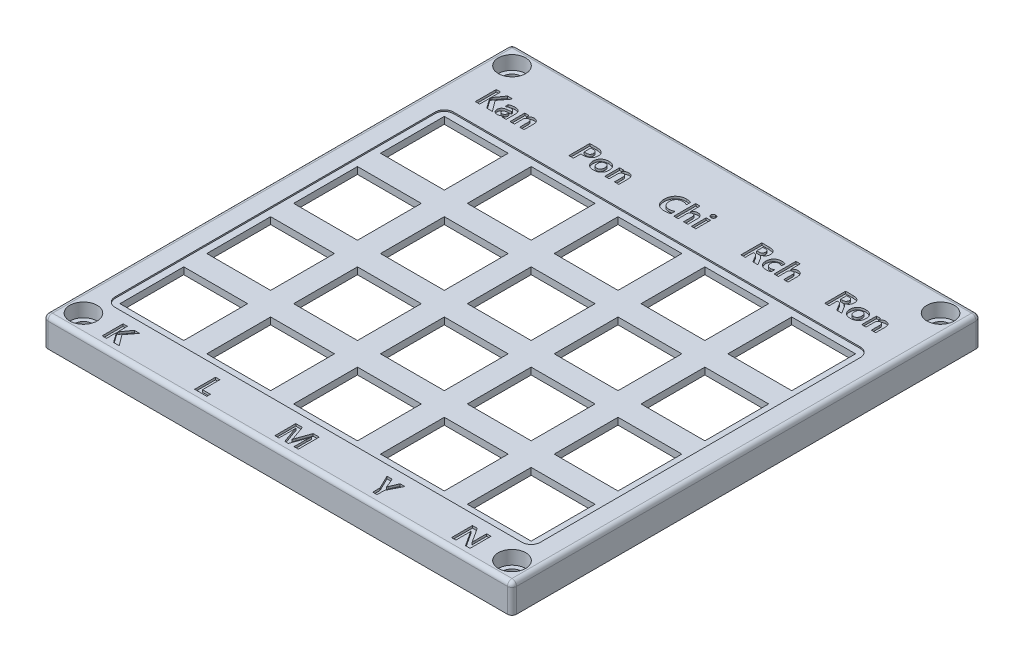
from build123d import *

# Parameters (mm, degrees)
SKETCH_1_W                  = 102.8
SKETCH_1_H                  = 102.8
EXTRUDE_1_DEPTH             = 5
SKETCH_2_W                  = 99.2
SKETCH_2_H                  = 99.2
CUT_EXTRUDE_1_DEPTH         = 3.5
SKETCH_31_W                 = 14
SKETCH_31_H                 = 14
CUT_EXTRUDE_6_DEPTH         = 146.423278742
EXTRUDE_15_REACH            = 147.467
SKETCH_29_R                 = 2
PATTERN_LINEAR_2_COUNT      = 4
PATTERN_LINEAR_2_PITCH      = 19.05
PATTERN_LINEAR_2_COUNT_DIR2 = 5
PATTERN_LINEAR_2_PITCH_DIR2 = 19.05
SKETCH_33_W                 = 102.8
SKETCH_33_H                 = 102.8
EXTRUDE_17_DEPTH            = 0.3
SKETCH_41_W                 = 102.8
SKETCH_41_H                 = 102.8
SKETCH_41_W_2               = 101
SKETCH_41_H_2               = 101
EXTRUDE_22_DEPTH            = 1
MIRROR_3_COPY_1_REACH       = 147.467
MIRROR_3_COPY_1_SKETCH_R    = 2
SKETCH_44_W                 = 0.950207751
SKETCH_44_H                 = 3.241885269
CUT_EXTRUDE_8_DEPTH         = 0.5
SKETCH_43_R                 = 3
CUT_EXTRUDE_9_DEPTH         = 3
MIRROR_5_COPY_1_SKETCH_R    = 3
MIRROR_5_COPY_1_DEPTH       = 3
FILLET_7_R                  = 1
SKETCH_45_W                 = 18.05
SKETCH_45_H                 = 18.05
EXTRUDE_23_DEPTH            = 1


with BuildPart() as part:
    # Sketch 1 → Extrude 1 (new body)
    with BuildSketch(Plane(origin=(0, 0, 0), x_dir=(1, 0, 0), z_dir=(0, 1, 0))):
        with Locations((51.4, -51.4)):
            Rectangle(SKETCH_1_W, SKETCH_1_H)
    extrude(amount=EXTRUDE_1_DEPTH)

    # Sketch 2 → Cut-Extrude 1 (cut)
    with BuildSketch(Plane.XZ):
        with Locations((51.4, 51.4)):
            Rectangle(SKETCH_2_W, SKETCH_2_H)
    extrude(amount=-CUT_EXTRUDE_1_DEPTH, mode=Mode.SUBTRACT)

    # Sketch 31 → Cut-Extrude 6 (cut, through all)
    with BuildSketch(Plane.XZ.offset(-3.5)):
        with Locations((13.303, 85.3)):
            Rectangle(SKETCH_31_W, SKETCH_31_H)
    cut_extrude_6 = extrude(amount=-CUT_EXTRUDE_6_DEPTH, mode=Mode.SUBTRACT)

    # Sketch 29 → Extrude 15 (add, up to next)
    with BuildSketch(Plane.XZ, mode=Mode.PRIVATE) as extrude_15_sk1:
        with BuildLine():
            Line((101, 8.8), (101, 1.8))
            Line((101, 1.8), (94, 1.8))
            ThreePointArc((94, 1.8), (96.050252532, 6.749747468), (101, 8.8))
        make_face()
        with Locations(Location((98.4, 4.4, 0), (0, 0, 270))):
            Circle(SKETCH_29_R, mode=Mode.SUBTRACT)
    extrude_15_tool1 = extrude(extrude_15_sk1.sketch, amount=-EXTRUDE_15_REACH, mode=Mode.PRIVATE) - part.part
    extrude_15 = extrude_15_tool1.solids().sort_by_distance((100.901005, 0, 5.3))[0]
    add(extrude_15)

    # Mirror 1: Extrude 15 across plane
    add(extrude_15.mirror(Plane.ZY.offset(-51.4)))

    # Pattern Linear 2: Cut-Extrude 6 4 × 5
    with Locations(*[(j * PATTERN_LINEAR_2_PITCH_DIR2, 0, -i * PATTERN_LINEAR_2_PITCH) for i in range(PATTERN_LINEAR_2_COUNT) for j in range(PATTERN_LINEAR_2_COUNT_DIR2) if (i, j) != (0, 0)]):
        add(cut_extrude_6, mode=Mode.SUBTRACT)

    # Sketch 33 → Extrude 17 (add)
    with BuildSketch(Plane(origin=(0, 5, 0), x_dir=(1, 0, 0), z_dir=(0, 1, 0))):
        with Locations((51.4, -51.4)):
            Rectangle(SKETCH_33_W, SKETCH_33_H)
        with BuildLine():
            Line((6.773, -19.62), (96.033, -19.62))
            ThreePointArc((96.033, -19.62), (97.447213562, -20.205786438), (98.033, -21.62))
            Line((98.033, -21.62), (98.033, -91.83))
            ThreePointArc((98.033, -91.83), (97.447213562, -93.244213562), (96.033, -93.83))
            Line((96.033, -93.83), (6.773, -93.83))
            ThreePointArc((6.773, -93.83), (5.358786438, -93.244213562), (4.773, -91.83))
            Line((4.773, -91.83), (4.773, -21.62))
            ThreePointArc((4.773, -21.62), (5.358786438, -20.205786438), (6.773, -19.62))
        make_face(mode=Mode.SUBTRACT)
    extrude(amount=EXTRUDE_17_DEPTH)

    # Sketch 41 → Extrude 22 (add)
    with BuildSketch(Plane.XZ):
        with Locations((51.4, 51.4)):
            Rectangle(SKETCH_41_W, SKETCH_41_H)
        with Locations((51.4, 51.4)):
            Rectangle(SKETCH_41_W_2, SKETCH_41_H_2, mode=Mode.SUBTRACT)
    extrude(amount=EXTRUDE_22_DEPTH)

    # Mirror 3: Extrude 15 across plane
    add(extrude_15.mirror(Plane.XY.offset(51.4)))

    # Mirror 3 copy 1 sketch → Mirror 3 copy 1 (add, up to next)
    with BuildSketch(Plane(origin=(102.8, 0, 102.8), x_dir=(-1, 0, 0), z_dir=(0, -1, 0)), mode=Mode.PRIVATE) as mirror_3_copy_1_sk1:
        with BuildLine():
            Line((101, 8.8), (101, 1.8))
            Line((101, 1.8), (94, 1.8))
            ThreePointArc((94, 1.8), (96.050252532, 6.749747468), (101, 8.8))
        make_face()
        with Locations(Location((98.4, 4.4, 0), (0, 0, 270))):
            Circle(MIRROR_3_COPY_1_SKETCH_R, mode=Mode.SUBTRACT)
    mirror_3_copy_1_tool1 = extrude(mirror_3_copy_1_sk1.sketch, amount=-MIRROR_3_COPY_1_REACH, mode=Mode.PRIVATE) - part.part
    add(mirror_3_copy_1_tool1.solids().sort_by_distance((1.898995, 0, 97.5))[0])

    # Sketch 44 → Cut-Extrude 8 (cut)
    # profile 1 of 21: a face of its own
    with BuildSketch(Plane(origin=(0, 5.3, 0), x_dir=(1, 0, 0), z_dir=(0, 1, 0))):
        with BuildLine():
            Line((10.934270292, -15.232214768), (9.701969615, -15.232214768))
            Line((9.701969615, -15.232214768), (8.278404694, -13.228743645))
            add(Edge.make_bspline(
                [(8.278404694, -13.228743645), (8.268839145, -13.214335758), (8.247738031, -13.182552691), (8.219255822, -13.127163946), (8.186143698, -13.062463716), (8.165461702, -13.014906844), (8.154388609, -12.989445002)],
                knots=[0, 0, 0, 0, 0.768386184, 1.695020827, 2.76591936, 4, 4, 4, 4], degree=3))
            Line((8.154388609, -12.989445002), (8.139541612, -12.989445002))
            Line((8.139541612, -12.989445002), (8.139541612, -15.232214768))
            Line((8.139541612, -15.232214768), (7.189333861, -15.232214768))
            Line((7.189333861, -15.232214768), (7.189333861, -10.648859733))
            Line((7.189333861, -10.648859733), (8.139541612, -10.648859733))
            Line((8.139541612, -10.648859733), (8.139541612, -12.81477446))
            Line((8.139541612, -12.81477446), (8.154388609, -12.81477446))
            add(Edge.make_bspline(
                [(8.154388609, -12.81477446), (8.176069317, -12.770122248), (8.216800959, -12.686233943), (8.265318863, -12.606605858), (8.288011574, -12.569362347)],
                knots=[0, 0, 0, 0, 1.064563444, 2, 2, 2, 2], degree=3))
            Line((8.288011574, -12.569362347), (9.660922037, -10.648859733))
            Line((9.660922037, -10.648859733), (10.822481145, -10.648859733))
            Line((10.822481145, -10.648859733), (9.14651729, -12.835734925))
            Line((9.14651729, -12.835734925), (10.934270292, -15.232214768))
        make_face()
    # profile 2 of 21: a face of its own
    with BuildSketch(Plane(origin=(0, 5.3, 0), x_dir=(1, 0, 0), z_dir=(0, 1, 0))):
        with BuildLine():
            add(Edge.make_bspline(
                [(11.381426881, -12.210414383), (11.420693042, -12.190205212), (11.50358324, -12.147543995), (11.641720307, -12.094905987), (11.798285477, -12.049550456), (11.967856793, -12.010117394), (12.139392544, -11.976585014), (12.30327742, -11.953438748), (12.45356425, -11.936864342), (12.549642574, -11.935218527), (12.595387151, -11.934434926)],
                knots=[0, 0, 0, 0, 0.844161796, 1.782011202, 2.821464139, 3.959991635, 5.110977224, 6.163000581, 7.125372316, 8, 8, 8, 8], degree=3))
            add(Edge.make_bspline(
                [(12.595387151, -11.934434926), (12.650159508, -11.935367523), (12.756449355, -11.937177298), (12.910592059, -11.953212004), (13.054566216, -11.978668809), (13.187450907, -12.016456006), (13.310403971, -12.063520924), (13.422582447, -12.121850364), (13.523653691, -12.191857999), (13.615711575, -12.270331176), (13.695512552, -12.36117342), (13.764157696, -12.463003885), (13.822409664, -12.575021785), (13.870944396, -12.697207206), (13.906969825, -12.830373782), (13.934132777, -12.973377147), (13.949766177, -13.127379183), (13.951619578, -13.233366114), (13.952577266, -13.28813163)],
                knots=[0, 0, 0, 0, 1.195033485, 2.319051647, 3.37828662, 4.38189099, 5.329303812, 6.247200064, 7.133620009, 8.0074276, 8.88063446, 9.763472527, 10.681368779, 11.631100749, 12.62687191, 13.687268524, 14.804966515, 16, 16, 16, 16], degree=3))
            Line((13.952577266, -13.28813163), (13.952577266, -15.232214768))
            Line((13.952577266, -15.232214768), (13.058264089, -15.232214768))
            Line((13.058264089, -15.232214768), (13.058264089, -14.76933783))
            Line((13.058264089, -14.76933783), (13.046037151, -14.76933783))
            add(Edge.make_bspline(
                [(13.046037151, -14.76933783), (13.017617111, -14.81056584), (12.961925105, -14.891356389), (12.863106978, -14.997532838), (12.754936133, -15.088094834), (12.635905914, -15.160584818), (12.50779733, -15.218249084), (12.370057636, -15.258942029), (12.22251815, -15.284173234), (12.120970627, -15.286772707), (12.068755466, -15.288109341)],
                knots=[0, 0, 0, 0, 1.036379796, 2.030893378, 2.994715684, 3.950597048, 4.909063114, 5.897577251, 6.918946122, 8, 8, 8, 8], degree=3))
            add(Edge.make_bspline(
                [(12.068755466, -15.288109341), (12.030887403, -15.287143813), (11.957017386, -15.285260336), (11.849106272, -15.274297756), (11.74719582, -15.253932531), (11.650952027, -15.226178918), (11.560033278, -15.19034695), (11.47556351, -15.145465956), (11.395927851, -15.09398989), (11.323666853, -15.033453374), (11.25837368, -14.966487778), (11.200741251, -14.893772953), (11.153618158, -14.814063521), (11.114121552, -14.729313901), (11.083527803, -14.63879068), (11.061738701, -14.542823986), (11.048401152, -14.44104192), (11.046853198, -14.371130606), (11.046059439, -14.335281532)],
                knots=[0, 0, 0, 0, 1.151241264, 2.245750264, 3.292235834, 4.305995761, 5.287015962, 6.256796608, 7.20909936, 8.164234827, 9.11542683, 10.048331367, 10.977113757, 11.923353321, 12.886001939, 13.875605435, 14.910654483, 16, 16, 16, 16], degree=3))
            add(Edge.make_bspline(
                [(11.046059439, -14.335281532), (11.046861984, -14.298271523), (11.048428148, -14.226046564), (11.061667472, -14.120759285), (11.083795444, -14.0215116), (11.112941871, -13.927466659), (11.152284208, -13.839782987), (11.201517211, -13.75889561), (11.256688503, -13.682091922), (11.323127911, -13.613297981), (11.397164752, -13.549932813), (11.479270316, -13.491953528), (11.571103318, -13.441563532), (11.67100495, -13.396213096), (11.779350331, -13.355742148), (11.896933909, -13.323047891), (12.022982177, -13.295945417), (12.110302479, -13.282711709), (12.155217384, -13.275904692)],
                knots=[0, 0, 0, 0, 1.040433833, 2.030404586, 2.977796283, 3.896860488, 4.794531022, 5.671967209, 6.556098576, 7.447814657, 8.353474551, 9.293695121, 10.268488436, 11.294197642, 12.376862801, 13.517047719, 14.72284492, 16, 16, 16, 16], degree=3))
            Line((12.155217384, -13.275904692), (13.045163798, -13.158002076))
            add(Edge.make_bspline(
                [(13.045163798, -13.158002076), (13.043872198, -13.114731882), (13.04142333, -13.032691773), (13.012956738, -12.91827204), (12.967703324, -12.820019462), (12.901989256, -12.73965696), (12.817273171, -12.678207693), (12.714461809, -12.635446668), (12.59434307, -12.609379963), (12.508195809, -12.606626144), (12.462637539, -12.605169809)],
                knots=[0, 0, 0, 0, 1.126537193, 2.135909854, 3.053075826, 3.927259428, 4.812815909, 5.755167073, 6.812838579, 8, 8, 8, 8], degree=3))
            add(Edge.make_bspline(
                [(12.462637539, -12.605169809), (12.415142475, -12.606172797), (12.320474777, -12.608171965), (12.179742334, -12.624408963), (12.041073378, -12.650614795), (11.904476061, -12.687510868), (11.769816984, -12.734608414), (11.637520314, -12.792843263), (11.506979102, -12.860518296), (11.423550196, -12.913690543), (11.381426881, -12.94053725)],
                knots=[0, 0, 0, 0, 0.992177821, 1.977620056, 2.955883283, 3.938599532, 4.931280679, 5.933698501, 6.95672286, 8, 8, 8, 8], degree=3))
            Line((11.381426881, -12.94053725), (11.381426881, -12.210414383))
        make_face()
        with BuildLine():
            add(Edge.make_bspline(
                [(12.443423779, -13.778955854), (12.403910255, -13.784923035), (12.32912038, -13.796217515), (12.226000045, -13.827867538), (12.138083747, -13.868573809), (12.065238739, -13.919594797), (12.008792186, -13.982020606), (11.96869028, -14.054607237), (11.944290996, -14.137243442), (11.941715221, -14.195662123), (11.940372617, -14.226112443)],
                knots=[0, 0, 0, 0, 1.281690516, 2.425940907, 3.45032824, 4.381560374, 5.261858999, 6.127999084, 7.024232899, 8, 8, 8, 8], degree=3))
            add(Edge.make_bspline(
                [(11.940372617, -14.226112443), (11.941817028, -14.254229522), (11.94460733, -14.308545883), (11.968154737, -14.385917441), (12.007085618, -14.454434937), (12.061650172, -14.512580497), (12.128190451, -14.560182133), (12.207246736, -14.593434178), (12.296278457, -14.613591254), (12.359178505, -14.616079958), (12.391895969, -14.617374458)],
                knots=[0, 0, 0, 0, 1.002064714, 1.935780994, 2.857447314, 3.791452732, 4.76036446, 5.756537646, 6.833062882, 8, 8, 8, 8], degree=3))
            add(Edge.make_bspline(
                [(12.391895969, -14.617374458), (12.415205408, -14.616565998), (12.460821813, -14.614983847), (12.527696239, -14.606625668), (12.59111061, -14.590507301), (12.651671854, -14.568582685), (12.709339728, -14.540955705), (12.763210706, -14.50616145), (12.813998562, -14.465699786), (12.86196202, -14.419994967), (12.90417377, -14.368398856), (12.941850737, -14.314092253), (12.974912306, -14.257335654), (12.999931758, -14.196255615), (13.01982619, -14.132793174), (13.035063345, -14.066591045), (13.043910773, -13.997246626), (13.044740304, -13.949867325), (13.045163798, -13.92567911)],
                knots=[0, 0, 0, 0, 1.051845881, 2.058454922, 3.033033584, 3.996758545, 4.959946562, 5.910701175, 6.882799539, 7.885804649, 8.892927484, 9.883737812, 10.865895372, 11.848754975, 12.853821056, 13.863679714, 14.909359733, 16, 16, 16, 16], degree=3))
            Line((13.045163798, -13.92567911), (13.045163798, -13.701227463))
            Line((13.045163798, -13.701227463), (12.443423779, -13.778955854))
        make_face(mode=Mode.SUBTRACT)
    # profile 3 of 21: a face of its own
    with BuildSketch(Plane(origin=(0, 5.3, 0), x_dir=(1, 0, 0), z_dir=(0, 1, 0))):
        with BuildLine():
            Line((17.865197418, -15.232214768), (16.914989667, -15.232214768))
            Line((16.914989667, -15.232214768), (16.914989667, -13.440095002))
            add(Edge.make_bspline(
                [(16.914989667, -13.440095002), (16.914860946, -13.408633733), (16.914611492, -13.347663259), (16.906826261, -13.259429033), (16.897342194, -13.176958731), (16.881006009, -13.101019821), (16.86240265, -13.030304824), (16.837877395, -12.966169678), (16.80993532, -12.90779494), (16.777705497, -12.85543995), (16.739483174, -12.810253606), (16.698844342, -12.769329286), (16.652633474, -12.735902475), (16.602035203, -12.708650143), (16.54737056, -12.686606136), (16.487886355, -12.672352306), (16.42482243, -12.661936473), (16.381127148, -12.661360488), (16.358663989, -12.661064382)],
                knots=[0, 0, 0, 0, 1.385577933, 2.685185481, 3.900730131, 5.040333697, 6.104607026, 7.119499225, 8.0603568, 8.953669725, 9.819198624, 10.662777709, 11.488914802, 12.321203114, 13.190620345, 14.077277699, 15.011554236, 16, 16, 16, 16], degree=3))
            add(Edge.make_bspline(
                [(16.358663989, -12.661064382), (16.337084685, -12.661787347), (16.29429664, -12.663220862), (16.231664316, -12.673040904), (16.171678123, -12.688425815), (16.114928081, -12.711754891), (16.060892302, -12.741564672), (16.009184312, -12.777344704), (15.960672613, -12.819910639), (15.915566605, -12.868475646), (15.875229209, -12.92239063), (15.838428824, -12.9793514), (15.809396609, -13.041165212), (15.783535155, -13.105606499), (15.764301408, -13.17413116), (15.751878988, -13.246173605), (15.742310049, -13.321358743), (15.74157723, -13.372814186), (15.741203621, -13.399047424)],
                knots=[0, 0, 0, 0, 0.962967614, 1.90939895, 2.82343066, 3.721059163, 4.639881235, 5.573469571, 6.522039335, 7.515047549, 8.526002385, 9.52460601, 10.535811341, 11.568577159, 12.621661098, 13.704858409, 14.829880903, 16, 16, 16, 16], degree=3))
            Line((15.741203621, -13.399047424), (15.741203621, -15.232214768))
            Line((15.741203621, -15.232214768), (14.79099587, -15.232214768))
            Line((14.79099587, -15.232214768), (14.79099587, -11.990329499))
            Line((14.79099587, -11.990329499), (15.741203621, -11.990329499))
            Line((15.741203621, -11.990329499), (15.741203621, -12.52831477))
            Line((15.741203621, -12.52831477), (15.752557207, -12.52831477))
            add(Edge.make_bspline(
                [(15.752557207, -12.52831477), (15.782637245, -12.481272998), (15.84143657, -12.38931752), (15.945685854, -12.267094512), (16.061732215, -12.164726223), (16.187162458, -12.079531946), (16.324253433, -12.015158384), (16.470599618, -11.966785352), (16.628151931, -11.940222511), (16.736442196, -11.93639381), (16.791846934, -11.934434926)],
                knots=[0, 0, 0, 0, 1.064617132, 2.081073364, 3.053068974, 4.009833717, 4.963950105, 5.933641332, 6.942785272, 8, 8, 8, 8], degree=3))
            add(Edge.make_bspline(
                [(16.791846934, -11.934434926), (16.835282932, -11.93533643), (16.919545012, -11.937085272), (17.041623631, -11.953575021), (17.155879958, -11.977836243), (17.261057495, -12.015142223), (17.358612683, -12.061320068), (17.446911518, -12.119414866), (17.527356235, -12.187356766), (17.59938402, -12.265571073), (17.662635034, -12.354539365), (17.7164051, -12.454024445), (17.763372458, -12.563124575), (17.800009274, -12.683105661), (17.830118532, -12.813175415), (17.85044908, -12.953685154), (17.862678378, -13.104508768), (17.864339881, -13.208340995), (17.865197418, -13.261931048)],
                knots=[0, 0, 0, 0, 1.067420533, 2.070703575, 3.024128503, 3.934192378, 4.808213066, 5.671854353, 6.525140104, 7.391387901, 8.279251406, 9.20186848, 10.167150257, 11.194978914, 12.281972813, 13.447160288, 14.682424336, 16, 16, 16, 16], degree=3))
            Line((17.865197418, -13.261931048), (17.865197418, -15.232214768))
        make_face()
    # profile 4 of 21: a face of its own
    with BuildSketch(Plane(origin=(0, 5.3, 0), x_dir=(1, 0, 0), z_dir=(0, 1, 0))):
        with BuildLine():
            Line((28.708744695, -13.611272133), (28.708744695, -15.232214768))
            Line((28.708744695, -15.232214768), (27.70264237, -15.232214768))
            Line((27.70264237, -15.232214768), (27.70264237, -10.648859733))
            Line((27.70264237, -10.648859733), (29.285157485, -10.648859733))
            add(Edge.make_bspline(
                [(29.285157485, -10.648859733), (29.354488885, -10.649618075), (29.488732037, -10.651086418), (29.683229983, -10.66938937), (29.864613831, -10.696495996), (30.032907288, -10.735712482), (30.188130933, -10.785835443), (30.329489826, -10.848344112), (30.458437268, -10.92031704), (30.572455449, -11.005996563), (30.674036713, -11.101704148), (30.762105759, -11.208931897), (30.835817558, -11.328107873), (30.896202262, -11.458350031), (30.943588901, -11.599778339), (30.976092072, -11.752737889), (30.996523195, -11.916416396), (30.999098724, -12.02927628), (31.000422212, -12.08727165)],
                knots=[0, 0, 0, 0, 1.298309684, 2.513856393, 3.656108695, 4.731525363, 5.747269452, 6.706842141, 7.622696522, 8.50723259, 9.371308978, 10.231556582, 11.09863924, 11.989139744, 12.915198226, 13.88644584, 14.913906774, 16, 16, 16, 16], degree=3))
            add(Edge.make_bspline(
                [(31.000422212, -12.08727165), (30.999063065, -12.144134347), (30.996401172, -12.25550007), (30.971102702, -12.417967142), (30.930981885, -12.572007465), (30.875184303, -12.717571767), (30.802694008, -12.854449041), (30.714227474, -12.982320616), (30.608936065, -13.101229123), (30.489013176, -13.210102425), (30.357731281, -13.30840003), (30.217207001, -13.393909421), (30.068156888, -13.464212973), (29.91177923, -13.522653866), (29.747023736, -13.566046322), (29.574036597, -13.595648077), (29.393177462, -13.611458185), (29.270048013, -13.611334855), (29.207429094, -13.611272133)],
                knots=[0, 0, 0, 0, 1.030121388, 2.017495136, 2.972350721, 3.911192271, 4.83654481, 5.773382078, 6.723046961, 7.709164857, 8.704418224, 9.691791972, 10.685519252, 11.687326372, 12.713900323, 13.768849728, 14.865322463, 16, 16, 16, 16], degree=3))
            Line((29.207429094, -13.611272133), (28.708744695, -13.611272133))
        make_face()
        with BuildLine():
            Line((28.682544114, -11.37548919), (28.682544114, -12.884642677))
            Line((28.682544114, -12.884642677), (29.114853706, -12.884642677))
            add(Edge.make_bspline(
                [(29.114853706, -12.884642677), (29.150399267, -12.884347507), (29.219303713, -12.883775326), (29.318998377, -12.873467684), (29.412226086, -12.859181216), (29.4983249, -12.838197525), (29.578211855, -12.812281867), (29.650335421, -12.779047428), (29.716341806, -12.740380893), (29.774674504, -12.694792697), (29.82670023, -12.64392312), (29.871902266, -12.587062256), (29.910645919, -12.524258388), (29.940550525, -12.454468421), (29.965849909, -12.379934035), (29.981500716, -12.298837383), (29.992576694, -12.212176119), (29.993726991, -12.152230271), (29.994319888, -12.121332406)],
                knots=[0, 0, 0, 0, 1.278344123, 2.478047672, 3.602593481, 4.669662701, 5.663414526, 6.61963354, 7.52146294, 8.409869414, 9.276518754, 10.133747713, 11.01763458, 11.92274315, 12.860188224, 13.844231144, 14.888852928, 16, 16, 16, 16], degree=3))
            add(Edge.make_bspline(
                [(29.994319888, -12.121332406), (29.99370443, -12.091312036), (29.992505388, -12.032825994), (29.981642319, -11.948135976), (29.965354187, -11.868792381), (29.942123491, -11.795366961), (29.911062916, -11.728045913), (29.873320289, -11.666411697), (29.828655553, -11.610466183), (29.777567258, -11.56003921), (29.719380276, -11.516097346), (29.654005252, -11.478618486), (29.58216365, -11.44611824), (29.503348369, -11.420171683), (29.417939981, -11.400311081), (29.32605805, -11.385438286), (29.227105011, -11.376691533), (29.158830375, -11.375898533), (29.123587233, -11.37548919)],
                knots=[0, 0, 0, 0, 1.096741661, 2.136685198, 3.115387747, 4.054179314, 4.944445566, 5.818542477, 6.689265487, 7.554510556, 8.435509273, 9.346142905, 10.303325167, 11.312720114, 12.373412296, 13.505155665, 14.712169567, 16, 16, 16, 16], degree=3))
            Line((29.123587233, -11.37548919), (28.682544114, -11.37548919))
        make_face(mode=Mode.SUBTRACT)
    # profile 5 of 21: a face of its own
    with BuildSketch(Plane(origin=(0, 5.3, 0), x_dir=(1, 0, 0), z_dir=(0, 1, 0))):
        with BuildLine():
            add(Edge.make_bspline(
                [(31.391684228, -13.62611913), (31.393181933, -13.562003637), (31.396105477, -13.436849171), (31.419177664, -13.25471409), (31.456509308, -13.082920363), (31.509382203, -12.92155897), (31.579516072, -12.771395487), (31.662059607, -12.630488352), (31.76189294, -12.501189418), (31.876403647, -12.383762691), (32.003007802, -12.277912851), (32.140948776, -12.185772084), (32.28960842, -12.107570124), (32.448593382, -12.043996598), (32.618111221, -11.995160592), (32.797393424, -11.959274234), (32.987671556, -11.938272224), (33.117958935, -11.935734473), (33.184677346, -11.934434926)],
                knots=[0, 0, 0, 0, 1.103453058, 2.15395801, 3.154678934, 4.126148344, 5.070148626, 6.002678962, 6.931877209, 7.874599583, 8.821044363, 9.767595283, 10.724805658, 11.707533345, 12.709834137, 13.757538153, 14.851665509, 16, 16, 16, 16], degree=3))
            add(Edge.make_bspline(
                [(33.184677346, -11.934434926), (33.249372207, -11.935672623), (33.375623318, -11.938087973), (33.559527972, -11.959898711), (33.733501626, -11.992858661), (33.896610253, -12.042652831), (34.050592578, -12.103955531), (34.19327665, -12.181621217), (34.326306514, -12.271766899), (34.447376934, -12.375942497), (34.557027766, -12.491168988), (34.652294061, -12.617279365), (34.733460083, -12.75270945), (34.799149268, -12.898189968), (34.850672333, -13.053007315), (34.887162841, -13.217453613), (34.909468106, -13.39115204), (34.91183247, -13.510185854), (34.913042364, -13.571097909)],
                knots=[0, 0, 0, 0, 1.154217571, 2.252439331, 3.300975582, 4.310246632, 5.291497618, 6.253956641, 7.203666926, 8.154399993, 9.098965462, 10.037337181, 10.969401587, 11.911118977, 12.880523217, 13.876343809, 14.913281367, 16, 16, 16, 16], degree=3))
            add(Edge.make_bspline(
                [(34.913042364, -13.571097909), (34.911432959, -13.634909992), (34.908285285, -13.759713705), (34.886637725, -13.941970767), (34.848970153, -14.114193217), (34.796463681, -14.276601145), (34.729426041, -14.429603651), (34.645672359, -14.571448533), (34.548131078, -14.703937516), (34.435409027, -14.824637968), (34.310850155, -14.934054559), (34.174221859, -15.029049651), (34.027179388, -15.109369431), (33.869519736, -15.175527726), (33.70127357, -15.225542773), (33.522825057, -15.262437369), (33.333703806, -15.284502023), (33.203950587, -15.286887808), (33.1375163, -15.288109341)],
                knots=[0, 0, 0, 0, 1.09727435, 2.146049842, 3.15059286, 4.124223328, 5.076775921, 6.016934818, 6.951103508, 7.900454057, 8.851281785, 9.797022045, 10.755907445, 11.727489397, 12.731570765, 13.76934414, 14.857893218, 16, 16, 16, 16], degree=3))
            add(Edge.make_bspline(
                [(33.1375163, -15.288109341), (33.07224666, -15.28683926), (32.944848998, -15.284360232), (32.759052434, -15.262981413), (32.583625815, -15.22843923), (32.418365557, -15.1793868), (32.263574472, -15.116603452), (32.118665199, -15.04015468), (31.984624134, -14.948916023), (31.861491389, -14.843971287), (31.750578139, -14.727550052), (31.654627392, -14.599484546), (31.573071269, -14.461921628), (31.506292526, -14.314026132), (31.454784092, -14.156123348), (31.418647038, -13.988116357), (31.394970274, -13.810488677), (31.392796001, -13.688497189), (31.391684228, -13.62611913)],
                knots=[0, 0, 0, 0, 1.149013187, 2.242721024, 3.288275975, 4.293858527, 5.273402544, 6.22507903, 7.173436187, 8.122568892, 9.068984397, 9.998887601, 10.934313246, 11.879547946, 12.850577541, 13.85308481, 14.902215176, 16, 16, 16, 16], degree=3))
        make_face()
        with BuildLine():
            add(Edge.make_bspline(
                [(32.341891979, -13.613892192), (32.342577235, -13.652051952), (32.343908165, -13.726167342), (32.353750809, -13.833788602), (32.368795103, -13.934380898), (32.391694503, -14.02720106), (32.420231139, -14.112846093), (32.456371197, -14.19078575), (32.497970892, -14.26222242), (32.54725387, -14.325426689), (32.602866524, -14.380951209), (32.664586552, -14.429536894), (32.732903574, -14.47070694), (32.807905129, -14.503717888), (32.88882315, -14.53038492), (32.976507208, -14.547977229), (33.070520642, -14.55993342), (33.135437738, -14.560953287), (33.168956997, -14.561479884)],
                knots=[0, 0, 0, 0, 1.270888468, 2.468369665, 3.597092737, 4.655434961, 5.64897887, 6.599178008, 7.512182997, 8.396678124, 9.260629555, 10.123873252, 11.006932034, 11.909787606, 12.848136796, 13.838979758, 14.884179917, 16, 16, 16, 16], degree=3))
            add(Edge.make_bspline(
                [(33.168956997, -14.561479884), (33.201015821, -14.56091743), (33.263311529, -14.559824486), (33.353698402, -14.548268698), (33.438063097, -14.529290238), (33.515955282, -14.502220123), (33.587839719, -14.467791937), (33.653352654, -14.425984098), (33.713041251, -14.376186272), (33.76578087, -14.318666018), (33.813083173, -14.2538493), (33.852997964, -14.180869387), (33.88688765, -14.10030367), (33.914750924, -14.012577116), (33.936582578, -13.917365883), (33.952184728, -13.81462565), (33.960507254, -13.703984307), (33.962041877, -13.627878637), (33.962834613, -13.588564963)],
                knots=[0, 0, 0, 0, 1.070965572, 2.081066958, 3.039323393, 3.956285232, 4.830977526, 5.697350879, 6.546953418, 7.421375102, 8.299092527, 9.222381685, 10.194613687, 11.216177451, 12.294761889, 13.456137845, 14.68592486, 16, 16, 16, 16], degree=3))
            add(Edge.make_bspline(
                [(33.962834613, -13.588564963), (33.962040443, -13.550997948), (33.960505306, -13.478380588), (33.952233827, -13.372953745), (33.936401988, -13.27490162), (33.914840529, -13.184002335), (33.887141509, -13.100080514), (33.851755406, -13.024112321), (33.811809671, -12.954109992), (33.764505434, -12.8918938), (33.710584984, -12.837302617), (33.65105886, -12.789568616), (33.584466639, -12.750452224), (33.512596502, -12.716592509), (33.433820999, -12.69162625), (33.348847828, -12.674632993), (33.258087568, -12.662609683), (33.195199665, -12.661589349), (33.162843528, -12.661064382)],
                knots=[0, 0, 0, 0, 1.285280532, 2.484458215, 3.614137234, 4.679338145, 5.677637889, 6.631225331, 7.541609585, 8.429939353, 9.296111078, 10.160850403, 11.031874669, 11.931905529, 12.873562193, 13.850117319, 14.893874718, 16, 16, 16, 16], degree=3))
            add(Edge.make_bspline(
                [(33.162843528, -12.661064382), (33.131353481, -12.661530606), (33.069864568, -12.662440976), (32.980506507, -12.675490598), (32.896124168, -12.694230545), (32.817170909, -12.721186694), (32.743840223, -12.756771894), (32.675461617, -12.799287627), (32.612979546, -12.850671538), (32.556185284, -12.909290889), (32.505428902, -12.974869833), (32.461593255, -13.047388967), (32.423754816, -13.125836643), (32.394526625, -13.211386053), (32.370898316, -13.302764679), (32.353231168, -13.400496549), (32.344052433, -13.505127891), (32.342626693, -13.576904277), (32.341891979, -13.613892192)],
                knots=[0, 0, 0, 0, 1.057503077, 2.064929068, 3.028638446, 3.96006429, 4.861611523, 5.762946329, 6.660021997, 7.573438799, 8.50115664, 9.440922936, 10.416923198, 11.42268461, 12.474058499, 13.587313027, 14.756690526, 16, 16, 16, 16], degree=3))
        make_face(mode=Mode.SUBTRACT)
    # profile 6 of 21: a face of its own
    with BuildSketch(Plane(origin=(0, 5.3, 0), x_dir=(1, 0, 0), z_dir=(0, 1, 0))):
        with BuildLine():
            Line((38.657978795, -15.232214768), (37.707771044, -15.232214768))
            Line((37.707771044, -15.232214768), (37.707771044, -13.440095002))
            add(Edge.make_bspline(
                [(37.707771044, -13.440095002), (37.707642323, -13.408633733), (37.707392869, -13.347663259), (37.699607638, -13.259429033), (37.690123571, -13.176958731), (37.673787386, -13.101019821), (37.655184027, -13.030304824), (37.630658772, -12.966169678), (37.602716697, -12.90779494), (37.570486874, -12.85543995), (37.532264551, -12.810253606), (37.491625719, -12.769329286), (37.445414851, -12.735902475), (37.39481658, -12.708650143), (37.340151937, -12.686606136), (37.280667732, -12.672352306), (37.217603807, -12.661936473), (37.173908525, -12.661360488), (37.151445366, -12.661064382)],
                knots=[0, 0, 0, 0, 1.385577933, 2.685185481, 3.900730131, 5.040333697, 6.104607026, 7.119499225, 8.0603568, 8.953669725, 9.819198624, 10.662777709, 11.488914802, 12.321203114, 13.190620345, 14.077277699, 15.011554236, 16, 16, 16, 16], degree=3))
            add(Edge.make_bspline(
                [(37.151445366, -12.661064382), (37.129866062, -12.661787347), (37.087078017, -12.663220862), (37.024445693, -12.673040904), (36.9644595, -12.688425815), (36.907709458, -12.711754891), (36.853673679, -12.741564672), (36.801965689, -12.777344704), (36.75345399, -12.819910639), (36.708347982, -12.868475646), (36.668010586, -12.92239063), (36.631210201, -12.9793514), (36.602177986, -13.041165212), (36.576316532, -13.105606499), (36.557082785, -13.17413116), (36.544660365, -13.246173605), (36.535091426, -13.321358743), (36.534358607, -13.372814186), (36.533984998, -13.399047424)],
                knots=[0, 0, 0, 0, 0.962967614, 1.90939895, 2.82343066, 3.721059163, 4.639881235, 5.573469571, 6.522039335, 7.515047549, 8.526002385, 9.52460601, 10.535811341, 11.568577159, 12.621661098, 13.704858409, 14.829880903, 16, 16, 16, 16], degree=3))
            Line((36.533984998, -13.399047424), (36.533984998, -15.232214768))
            Line((36.533984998, -15.232214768), (35.583777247, -15.232214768))
            Line((35.583777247, -15.232214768), (35.583777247, -11.990329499))
            Line((35.583777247, -11.990329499), (36.533984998, -11.990329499))
            Line((36.533984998, -11.990329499), (36.533984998, -12.52831477))
            Line((36.533984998, -12.52831477), (36.545338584, -12.52831477))
            add(Edge.make_bspline(
                [(36.545338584, -12.52831477), (36.575418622, -12.481272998), (36.634217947, -12.38931752), (36.738467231, -12.267094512), (36.854513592, -12.164726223), (36.979943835, -12.079531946), (37.11703481, -12.015158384), (37.263380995, -11.966785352), (37.420933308, -11.940222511), (37.529223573, -11.93639381), (37.584628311, -11.934434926)],
                knots=[0, 0, 0, 0, 1.064617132, 2.081073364, 3.053068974, 4.009833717, 4.963950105, 5.933641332, 6.942785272, 8, 8, 8, 8], degree=3))
            add(Edge.make_bspline(
                [(37.584628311, -11.934434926), (37.628064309, -11.93533643), (37.712326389, -11.937085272), (37.834405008, -11.953575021), (37.948661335, -11.977836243), (38.053838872, -12.015142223), (38.15139406, -12.061320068), (38.239692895, -12.119414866), (38.320137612, -12.187356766), (38.392165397, -12.265571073), (38.455416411, -12.354539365), (38.509186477, -12.454024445), (38.556153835, -12.563124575), (38.592790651, -12.683105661), (38.622899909, -12.813175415), (38.643230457, -12.953685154), (38.655459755, -13.104508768), (38.657121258, -13.208340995), (38.657978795, -13.261931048)],
                knots=[0, 0, 0, 0, 1.067420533, 2.070703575, 3.024128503, 3.934192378, 4.808213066, 5.671854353, 6.525140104, 7.391387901, 8.279251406, 9.20186848, 10.167150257, 11.194978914, 12.281972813, 13.447160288, 14.682424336, 16, 16, 16, 16], degree=3))
            Line((38.657978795, -13.261931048), (38.657978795, -15.232214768))
        make_face()
    # profile 7 of 21: a face of its own
    with BuildSketch(Plane(origin=(0, 5.3, 0), x_dir=(1, 0, 0), z_dir=(0, 1, 0))):
        with BuildLine():
            add(Edge.make_bspline(
                [(49.948682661, -15.047937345), (49.906152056, -15.067215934), (49.819153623, -15.106651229), (49.680467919, -15.154738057), (49.533127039, -15.197083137), (49.375646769, -15.229726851), (49.209192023, -15.255702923), (49.033484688, -15.274884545), (48.848415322, -15.286429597), (48.72193035, -15.287539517), (48.656993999, -15.288109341)],
                knots=[0, 0, 0, 0, 0.845716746, 1.729954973, 2.656676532, 3.621929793, 4.6417922, 5.708383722, 6.823502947, 8, 8, 8, 8], degree=3))
            add(Edge.make_bspline(
                [(48.656993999, -15.288109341), (48.573649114, -15.286350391), (48.410805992, -15.282913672), (48.173431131, -15.253632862), (47.949156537, -15.205710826), (47.737884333, -15.138881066), (47.540133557, -15.051399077), (47.354443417, -14.946940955), (47.183329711, -14.820698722), (47.026428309, -14.676915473), (46.885703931, -14.516941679), (46.76303907, -14.343174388), (46.658251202, -14.157008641), (46.573292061, -13.957513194), (46.508143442, -13.745141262), (46.46092351, -13.5204131), (46.432795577, -13.283024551), (46.429174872, -13.120524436), (46.427324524, -13.037479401)],
                knots=[0, 0, 0, 0, 1.117762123, 2.183935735, 3.202706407, 4.190773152, 5.150779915, 6.098756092, 7.043129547, 7.996752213, 8.948654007, 9.895688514, 10.84514372, 11.809209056, 12.79865637, 13.820431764, 14.886140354, 16, 16, 16, 16], degree=3))
            add(Edge.make_bspline(
                [(46.427324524, -13.037479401), (46.429240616, -12.94975227), (46.432996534, -12.777789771), (46.465318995, -12.526137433), (46.516966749, -12.286352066), (46.591945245, -12.059322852), (46.686076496, -11.844126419), (46.802439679, -11.641574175), (46.940244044, -11.451756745), (47.097030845, -11.275104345), (47.26979606, -11.114399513), (47.457816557, -10.975408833), (47.657104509, -10.85597774), (47.869628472, -10.760306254), (48.093545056, -10.684362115), (48.330140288, -10.631779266), (48.578603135, -10.598450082), (48.748587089, -10.59481597), (48.835157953, -10.592965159)],
                knots=[0, 0, 0, 0, 1.092724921, 2.141956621, 3.155881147, 4.144687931, 5.115926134, 6.07787343, 7.0494435, 8.033601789, 9.016743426, 9.983827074, 10.941867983, 11.906137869, 12.882322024, 13.882875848, 14.921773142, 16, 16, 16, 16], degree=3))
            add(Edge.make_bspline(
                [(48.835157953, -10.592965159), (48.889604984, -10.593464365), (48.995938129, -10.594439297), (49.152135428, -10.602166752), (49.301559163, -10.616315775), (49.444388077, -10.635161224), (49.580458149, -10.659793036), (49.709758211, -10.689087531), (49.832284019, -10.724661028), (49.910407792, -10.753504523), (49.948682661, -10.767635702)],
                knots=[0, 0, 0, 0, 1.152842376, 2.251460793, 3.310132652, 4.330106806, 5.30101256, 6.237069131, 7.136294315, 8, 8, 8, 8], degree=3))
            Line((49.948682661, -10.767635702), (49.948682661, -11.710856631))
            add(Edge.make_bspline(
                [(49.948682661, -11.710856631), (49.909995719, -11.688417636), (49.832650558, -11.643556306), (49.710656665, -11.587070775), (49.585096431, -11.539187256), (49.455904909, -11.499506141), (49.322799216, -11.468955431), (49.185647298, -11.447349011), (49.04474348, -11.433826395), (48.949597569, -11.432203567), (48.901532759, -11.431383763)],
                knots=[0, 0, 0, 0, 0.977616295, 1.954506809, 2.935847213, 3.914561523, 4.907561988, 5.919664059, 6.949077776, 8, 8, 8, 8], degree=3))
            add(Edge.make_bspline(
                [(48.901532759, -11.431383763), (48.847329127, -11.432819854), (48.741195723, -11.435631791), (48.585858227, -11.45489419), (48.43873024, -11.487500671), (48.300713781, -11.535578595), (48.170216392, -11.594740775), (48.048504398, -11.668591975), (47.935122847, -11.755533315), (47.831583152, -11.85518117), (47.738011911, -11.965057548), (47.656728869, -12.084400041), (47.587051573, -12.211418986), (47.531669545, -12.347096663), (47.485950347, -12.489880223), (47.456846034, -12.641813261), (47.436350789, -12.801406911), (47.434416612, -12.910772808), (47.433426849, -12.966737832)],
                knots=[0, 0, 0, 0, 1.087057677, 2.128512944, 3.134245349, 4.103677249, 5.054699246, 6.003010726, 6.952489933, 7.914720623, 8.879923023, 9.841941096, 10.806100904, 11.779866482, 12.777122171, 13.807734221, 14.878167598, 16, 16, 16, 16], degree=3))
            add(Edge.make_bspline(
                [(47.433426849, -12.966737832), (47.434614, -13.021224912), (47.436931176, -13.127577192), (47.454621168, -13.283030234), (47.483858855, -13.430190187), (47.526370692, -13.569160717), (47.579289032, -13.700405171), (47.644362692, -13.823728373), (47.721429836, -13.938660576), (47.810553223, -14.044297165), (47.909982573, -14.139245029), (48.01773598, -14.222777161), (48.134111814, -14.293649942), (48.259462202, -14.349768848), (48.392718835, -14.395002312), (48.534363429, -14.426890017), (48.684385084, -14.446578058), (48.787061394, -14.448638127), (48.839524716, -14.449690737)],
                knots=[0, 0, 0, 0, 1.133778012, 2.212999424, 3.251503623, 4.251984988, 5.233070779, 6.192496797, 7.148645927, 8.10747872, 9.063090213, 10.004712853, 10.93988099, 11.89158553, 12.857227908, 13.864018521, 14.908602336, 16, 16, 16, 16], degree=3))
            add(Edge.make_bspline(
                [(48.839524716, -14.449690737), (48.889624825, -14.448857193), (48.989123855, -14.447201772), (49.136434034, -14.433809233), (49.280514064, -14.411942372), (49.421148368, -14.381432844), (49.558585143, -14.342105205), (49.692437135, -14.293855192), (49.823103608, -14.237409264), (49.90676413, -14.192646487), (49.948682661, -14.170217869)],
                knots=[0, 0, 0, 0, 1.03962901, 2.064707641, 3.067009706, 4.062459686, 5.049217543, 6.031526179, 7.013686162, 8, 8, 8, 8], degree=3))
            Line((49.948682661, -14.170217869), (49.948682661, -15.047937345))
        make_face()
    # profile 8 of 21: a face of its own
    with BuildSketch(Plane(origin=(0, 5.3, 0), x_dir=(1, 0, 0), z_dir=(0, 1, 0))):
        with BuildLine():
            Line((53.805408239, -15.232214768), (52.855200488, -15.232214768))
            Line((52.855200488, -15.232214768), (52.855200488, -13.401667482))
            add(Edge.make_bspline(
                [(52.855200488, -13.401667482), (52.855062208, -13.371663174), (52.854794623, -13.31360204), (52.847172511, -13.229698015), (52.837134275, -13.151463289), (52.822468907, -13.079004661), (52.803177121, -13.012128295), (52.779925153, -12.950830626), (52.751773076, -12.895721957), (52.720275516, -12.845712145), (52.683481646, -12.802341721), (52.643083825, -12.764051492), (52.597672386, -12.732246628), (52.548064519, -12.706151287), (52.493977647, -12.686041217), (52.436362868, -12.671197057), (52.374265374, -12.662212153), (52.331511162, -12.661456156), (52.309355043, -12.661064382)],
                knots=[0, 0, 0, 0, 1.373038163, 2.656956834, 3.853878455, 4.983063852, 6.037573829, 7.037525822, 7.979294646, 8.866580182, 9.736886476, 10.576124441, 11.408134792, 12.266624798, 13.135501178, 14.043857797, 14.986286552, 16, 16, 16, 16], degree=3))
            add(Edge.make_bspline(
                [(52.309355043, -12.661064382), (52.287191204, -12.661767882), (52.243527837, -12.663153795), (52.179486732, -12.673162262), (52.118009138, -12.688364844), (52.060008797, -12.711758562), (52.004487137, -12.740259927), (51.952842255, -12.776793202), (51.903720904, -12.818902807), (51.857666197, -12.866735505), (51.815634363, -12.919681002), (51.780100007, -12.977794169), (51.749140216, -13.038938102), (51.724724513, -13.104346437), (51.705591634, -13.173340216), (51.691801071, -13.246074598), (51.682566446, -13.322537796), (51.681804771, -13.374856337), (51.681414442, -13.401667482)],
                knots=[0, 0, 0, 0, 0.977976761, 1.926640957, 2.855427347, 3.76698591, 4.680896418, 5.6041548, 6.551948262, 7.533464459, 8.530918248, 9.529364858, 10.535062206, 11.551782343, 12.605587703, 13.691801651, 14.817141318, 16, 16, 16, 16], degree=3))
            Line((51.681414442, -13.401667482), (51.681414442, -15.232214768))
            Line((51.681414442, -15.232214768), (50.731206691, -15.232214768))
            Line((50.731206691, -15.232214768), (50.731206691, -10.425281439))
            Line((50.731206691, -10.425281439), (51.681414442, -10.425281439))
            Line((51.681414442, -10.425281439), (51.681414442, -12.498620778))
            Line((51.681414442, -12.498620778), (51.692768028, -12.498620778))
            add(Edge.make_bspline(
                [(51.692768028, -12.498620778), (51.724452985, -12.453947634), (51.786316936, -12.366724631), (51.892415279, -12.250857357), (52.006830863, -12.152964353), (52.129038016, -12.072084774), (52.260669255, -12.011072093), (52.399483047, -11.96589683), (52.546762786, -11.939265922), (52.647526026, -11.936065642), (52.698870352, -11.934434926)],
                knots=[0, 0, 0, 0, 1.089272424, 2.126772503, 3.117193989, 4.079787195, 5.03360445, 5.995552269, 6.978625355, 8, 8, 8, 8], degree=3))
            add(Edge.make_bspline(
                [(52.698870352, -11.934434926), (52.743468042, -11.935351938), (52.830334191, -11.937138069), (52.956191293, -11.953529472), (53.07395794, -11.977688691), (53.182222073, -12.015310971), (53.28256566, -12.061196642), (53.374204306, -12.118385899), (53.456607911, -12.186219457), (53.53120714, -12.263716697), (53.595293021, -12.352893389), (53.652953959, -12.450950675), (53.699422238, -12.560516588), (53.739276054, -12.679460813), (53.767961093, -12.809282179), (53.790056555, -12.948934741), (53.803040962, -13.098951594), (53.804603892, -13.202518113), (53.805408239, -13.255817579)],
                knots=[0, 0, 0, 0, 1.084703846, 2.112756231, 3.084004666, 4.004749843, 4.895351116, 5.764160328, 6.624961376, 7.486782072, 8.373769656, 9.291129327, 10.249242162, 11.264053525, 12.33981432, 13.480027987, 14.703121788, 16, 16, 16, 16], degree=3))
            Line((53.805408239, -13.255817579), (53.805408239, -15.232214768))
        make_face()
    # profile 9 of 21: a face of its own
    with BuildSketch(Plane(origin=(0, 5.3, 0), x_dir=(1, 0, 0), z_dir=(0, 1, 0))):
        with BuildLine():
            add(Edge.make_bspline(
                [(54.532037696, -10.923965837), (54.533648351, -10.88850182), (54.536772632, -10.819710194), (54.56788649, -10.72220235), (54.617753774, -10.63531763), (54.68701423, -10.561102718), (54.770275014, -10.499769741), (54.867202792, -10.456777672), (54.974522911, -10.429686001), (55.050055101, -10.42678586), (55.089236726, -10.425281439)],
                knots=[0, 0, 0, 0, 1.013028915, 1.965031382, 2.898897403, 3.860779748, 4.851395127, 5.840219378, 6.879633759, 8, 8, 8, 8], degree=3))
            add(Edge.make_bspline(
                [(55.089236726, -10.425281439), (55.129297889, -10.426712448), (55.206352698, -10.429464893), (55.315627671, -10.457381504), (55.413008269, -10.502115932), (55.496001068, -10.564873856), (55.564825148, -10.639595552), (55.614810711, -10.725937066), (55.644887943, -10.822162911), (55.648217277, -10.889395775), (55.649929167, -10.923965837)],
                knots=[0, 0, 0, 0, 1.142627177, 2.19776242, 3.198786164, 4.185327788, 5.151100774, 6.082777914, 7.014195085, 8, 8, 8, 8], degree=3))
            add(Edge.make_bspline(
                [(55.649929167, -10.923965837), (55.648267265, -10.958839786), (55.645017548, -11.027033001), (55.6138716, -11.124617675), (55.563106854, -11.212671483), (55.493324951, -11.289332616), (55.40943224, -11.353467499), (55.311603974, -11.397803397), (55.204217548, -11.427490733), (55.128460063, -11.430055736), (55.089236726, -11.431383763)],
                knots=[0, 0, 0, 0, 0.988219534, 1.93238422, 2.877019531, 3.854909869, 4.858781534, 5.853896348, 6.888857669, 8, 8, 8, 8], degree=3))
            add(Edge.make_bspline(
                [(55.089236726, -11.431383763), (55.050602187, -11.430022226), (54.975721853, -11.427383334), (54.869026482, -11.397818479), (54.772011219, -11.352645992), (54.688236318, -11.288213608), (54.619094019, -11.210994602), (54.568267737, -11.123124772), (54.536926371, -11.026184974), (54.533691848, -10.958553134), (54.532037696, -10.923965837)],
                knots=[0, 0, 0, 0, 1.099806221, 2.131612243, 3.134962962, 4.136936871, 5.125630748, 6.074715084, 7.015398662, 8, 8, 8, 8], degree=3))
        make_face()
    # profile 10 of 21: a face of its own
    with BuildSketch(Plane(origin=(0, 5.3, 0), x_dir=(1, 0, 0), z_dir=(0, 1, 0))):
        with Locations((55.063036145, -13.611272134)):
            Rectangle(SKETCH_44_W, SKETCH_44_H)
    # profile 11 of 21: a face of its own
    with BuildSketch(Plane(origin=(0, 5.3, 0), x_dir=(1, 0, 0), z_dir=(0, 1, 0))):
        with BuildLine():
            Line((69.176415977, -15.232214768), (68.062891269, -15.232214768))
            Line((68.062891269, -15.232214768), (67.351108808, -14.030481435))
            add(Edge.make_bspline(
                [(67.351108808, -14.030481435), (67.332854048, -14.00073481), (67.297957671, -13.94387022), (67.246378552, -13.862853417), (67.196845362, -13.790625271), (67.149569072, -13.726598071), (67.105022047, -13.670653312), (67.063533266, -13.622113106), (67.023521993, -13.582960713), (66.974806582, -13.542206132), (66.914184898, -13.502471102), (66.838258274, -13.469107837), (66.76013372, -13.447716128), (66.706998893, -13.444966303), (66.680373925, -13.443588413)],
                knots=[0, 0, 0, 0, 1.344687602, 2.570547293, 3.699885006, 4.718342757, 5.636226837, 6.4550131, 7.176785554, 7.789997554, 8.90063289, 9.955199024, 10.975384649, 12, 12, 12, 12], degree=3))
            Line((66.680373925, -13.443588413), (66.381687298, -13.443588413))
            Line((66.381687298, -13.443588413), (66.381687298, -15.232214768))
            Line((66.381687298, -15.232214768), (65.431479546, -15.232214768))
            Line((65.431479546, -15.232214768), (65.431479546, -10.648859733))
            Line((65.431479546, -10.648859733), (67.009627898, -10.648859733))
            add(Edge.make_bspline(
                [(67.009627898, -10.648859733), (67.074570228, -10.649959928), (67.200243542, -10.652088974), (67.382888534, -10.665767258), (67.552741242, -10.689847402), (67.710389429, -10.723959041), (67.85548389, -10.767131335), (67.988186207, -10.820207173), (68.108091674, -10.883639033), (68.216081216, -10.955888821), (68.311697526, -11.038462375), (68.39302597, -11.131976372), (68.463111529, -11.234273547), (68.5197775, -11.346520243), (68.563748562, -11.46857904), (68.59465398, -11.600150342), (68.614483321, -11.741405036), (68.61645565, -11.838878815), (68.617470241, -11.889020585)],
                knots=[0, 0, 0, 0, 1.344792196, 2.602377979, 3.789948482, 4.894324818, 5.93942703, 6.921166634, 7.848816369, 8.743320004, 9.60643787, 10.456510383, 11.302554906, 12.16796436, 13.052787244, 13.982706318, 14.96227809, 16, 16, 16, 16], degree=3))
            add(Edge.make_bspline(
                [(68.617470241, -11.889020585), (68.61658086, -11.927187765), (68.614831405, -12.002264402), (68.602496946, -12.113011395), (68.581492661, -12.219568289), (68.552634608, -12.322101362), (68.516058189, -12.420515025), (68.470179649, -12.514531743), (68.415966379, -12.604439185), (68.353942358, -12.689974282), (68.284947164, -12.770240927), (68.209546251, -12.845012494), (68.127547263, -12.912877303), (68.039167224, -12.974484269), (67.945349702, -13.030338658), (67.844585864, -13.079193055), (67.73846281, -13.123480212), (67.663985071, -13.146385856), (67.626214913, -13.158002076)],
                knots=[0, 0, 0, 0, 1.054005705, 2.073278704, 3.072957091, 4.050336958, 5.012048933, 5.968537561, 6.935110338, 7.908082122, 8.883044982, 9.855219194, 10.837283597, 11.818689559, 12.82802068, 13.849194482, 14.909254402, 16, 16, 16, 16], degree=3))
            Line((67.626214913, -13.158002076), (67.626214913, -13.170229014))
            add(Edge.make_bspline(
                [(67.626214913, -13.170229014), (67.653105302, -13.180773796), (67.709621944, -13.202936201), (67.790699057, -13.25497013), (67.874690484, -13.319663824), (67.960468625, -13.400211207), (68.048283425, -13.495582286), (68.138370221, -13.606128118), (68.229788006, -13.732252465), (68.289446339, -13.822672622), (68.320530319, -13.869784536)],
                knots=[0, 0, 0, 0, 0.69086025, 1.452009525, 2.2978205, 3.231026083, 4.267962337, 5.403581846, 6.647179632, 8, 8, 8, 8], degree=3))
            Line((68.320530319, -13.869784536), (69.176415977, -15.232214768))
        make_face()
        with BuildLine():
            Line((66.398280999, -11.37548919), (66.398280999, -12.716958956))
            Line((66.398280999, -12.716958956), (66.867271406, -12.716958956))
            add(Edge.make_bspline(
                [(66.867271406, -12.716958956), (66.894664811, -12.716254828), (66.948168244, -12.714879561), (67.026207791, -12.705130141), (67.10012046, -12.689322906), (67.170324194, -12.667868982), (67.236014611, -12.638700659), (67.297573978, -12.603722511), (67.354714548, -12.562135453), (67.407824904, -12.515231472), (67.455779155, -12.463275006), (67.496560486, -12.406668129), (67.533139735, -12.348305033), (67.561835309, -12.286013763), (67.583809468, -12.220658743), (67.599440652, -12.15219904), (67.609235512, -12.080565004), (67.610650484, -12.031699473), (67.611367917, -12.006923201)],
                knots=[0, 0, 0, 0, 1.139255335, 2.225136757, 3.26536478, 4.280265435, 5.272446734, 6.248687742, 7.219959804, 8.206435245, 9.192018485, 10.153504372, 11.104641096, 12.052689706, 12.998493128, 13.967800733, 14.969614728, 16, 16, 16, 16], degree=3))
            add(Edge.make_bspline(
                [(67.611367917, -12.006923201), (67.611014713, -11.98126953), (67.610334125, -11.931837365), (67.600858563, -11.86006793), (67.587817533, -11.793110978), (67.567100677, -11.731277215), (67.541943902, -11.673905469), (67.51065304, -11.621594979), (67.473285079, -11.574381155), (67.430079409, -11.532628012), (67.382157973, -11.494318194), (67.327119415, -11.463370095), (67.267300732, -11.435981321), (67.201808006, -11.413411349), (67.130485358, -11.395942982), (67.053640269, -11.383963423), (66.971034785, -11.377094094), (66.914154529, -11.376036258), (66.88473846, -11.37548919)],
                knots=[0, 0, 0, 0, 1.115541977, 2.149542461, 3.145912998, 4.079405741, 4.981150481, 5.867636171, 6.724381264, 7.5934034, 8.477895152, 9.386201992, 10.333011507, 11.338682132, 12.395710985, 13.52462607, 14.719841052, 16, 16, 16, 16], degree=3))
            Line((66.88473846, -11.37548919), (66.398280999, -11.37548919))
        make_face(mode=Mode.SUBTRACT)
    # profile 12 of 21: a face of its own
    with BuildSketch(Plane(origin=(0, 5.3, 0), x_dir=(1, 0, 0), z_dir=(0, 1, 0))):
        with BuildLine():
            add(Edge.make_bspline(
                [(71.971144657, -15.092478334), (71.941394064, -15.108101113), (71.880185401, -15.14024331), (71.781189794, -15.180324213), (71.673077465, -15.212824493), (71.556641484, -15.241439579), (71.430644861, -15.261305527), (71.296118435, -15.277606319), (71.15232895, -15.285732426), (71.053549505, -15.287300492), (71.002596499, -15.288109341)],
                knots=[0, 0, 0, 0, 0.807359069, 1.661054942, 2.561856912, 3.519052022, 4.54055789, 5.62547359, 6.77515755, 8, 8, 8, 8], degree=3))
            add(Edge.make_bspline(
                [(71.002596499, -15.288109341), (70.942272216, -15.286816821), (70.823867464, -15.284279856), (70.650845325, -15.262937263), (70.486436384, -15.228315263), (70.331345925, -15.178938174), (70.184298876, -15.117552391), (70.047625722, -15.039263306), (69.918051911, -14.94974881), (69.800347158, -14.844504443), (69.692599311, -14.730098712), (69.599793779, -14.605173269), (69.520744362, -14.472641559), (69.455417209, -14.332067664), (69.405911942, -14.182767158), (69.370199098, -14.025433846), (69.347685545, -13.859955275), (69.345310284, -13.74671505), (69.344099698, -13.689000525)],
                knots=[0, 0, 0, 0, 1.117352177, 2.193143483, 3.22460299, 4.225950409, 5.204744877, 6.170824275, 7.138979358, 8.117268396, 9.090443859, 10.046229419, 10.994390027, 11.945231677, 12.912349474, 13.90284451, 14.931154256, 16, 16, 16, 16], degree=3))
            add(Edge.make_bspline(
                [(69.344099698, -13.689000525), (69.345616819, -13.622851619), (69.348580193, -13.493643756), (69.371429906, -13.3053334), (69.409584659, -13.127692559), (69.46407372, -12.961015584), (69.532833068, -12.804534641), (69.618311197, -12.659284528), (69.719448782, -12.525147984), (69.834603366, -12.401948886), (69.963009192, -12.291979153), (70.102883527, -12.196311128), (70.252683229, -12.114921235), (70.412575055, -12.047910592), (70.583229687, -11.99770288), (70.763819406, -11.961370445), (70.954521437, -11.937753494), (71.085202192, -11.935556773), (71.151939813, -11.934434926)],
                knots=[0, 0, 0, 0, 1.114744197, 2.177416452, 3.191854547, 4.172549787, 5.128138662, 6.067322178, 7.006505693, 7.954251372, 8.904280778, 9.850208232, 10.805356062, 11.773150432, 12.766724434, 13.798343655, 14.875631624, 16, 16, 16, 16], degree=3))
            add(Edge.make_bspline(
                [(71.151939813, -11.934434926), (71.196782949, -11.934956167), (71.283323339, -11.935962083), (71.408590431, -11.943122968), (71.524974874, -11.953906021), (71.632211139, -11.970611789), (71.730729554, -11.991062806), (71.819909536, -12.017496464), (71.900911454, -12.047365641), (71.95010246, -12.072541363), (71.973764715, -12.084651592)],
                knots=[0, 0, 0, 0, 1.275766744, 2.462034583, 3.568873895, 4.599720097, 5.548433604, 6.429044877, 7.244326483, 8, 8, 8, 8], degree=3))
            Line((71.973764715, -12.084651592), (71.973764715, -12.884642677))
            add(Edge.make_bspline(
                [(71.973764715, -12.884642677), (71.94636322, -12.866754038), (71.892121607, -12.831343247), (71.807007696, -12.78605424), (71.720376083, -12.74739042), (71.631900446, -12.715877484), (71.541417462, -12.691172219), (71.449104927, -12.673996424), (71.354823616, -12.66298951), (71.291415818, -12.661710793), (71.259362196, -12.661064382)],
                knots=[0, 0, 0, 0, 1.032809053, 2.044458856, 3.040283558, 4.025874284, 5.006997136, 5.998527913, 6.988224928, 8, 8, 8, 8], degree=3))
            add(Edge.make_bspline(
                [(71.259362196, -12.661064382), (71.223820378, -12.662031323), (71.154301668, -12.66392263), (71.052785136, -12.674920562), (70.956518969, -12.695092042), (70.866079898, -12.724091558), (70.780220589, -12.759708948), (70.700538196, -12.804721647), (70.625887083, -12.857351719), (70.556983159, -12.917515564), (70.494761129, -12.984554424), (70.441339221, -13.058720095), (70.39533555, -13.138391), (70.3594023, -13.224759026), (70.328472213, -13.316017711), (70.309559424, -13.414150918), (70.296770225, -13.517776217), (70.295142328, -13.588813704), (70.294307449, -13.625245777)],
                knots=[0, 0, 0, 0, 1.1065263, 2.1643316, 3.173871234, 4.162656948, 5.116997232, 6.062345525, 7.005214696, 7.955761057, 8.904924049, 9.845700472, 10.795512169, 11.76173994, 12.753304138, 13.789460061, 14.866309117, 16, 16, 16, 16], degree=3))
            add(Edge.make_bspline(
                [(70.294307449, -13.625245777), (70.294774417, -13.660516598), (70.29568823, -13.729538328), (70.30876832, -13.829902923), (70.327188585, -13.925196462), (70.355601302, -14.014165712), (70.390297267, -14.097829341), (70.433473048, -14.175617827), (70.485228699, -14.247010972), (70.543756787, -14.312888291), (70.609386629, -14.371518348), (70.681324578, -14.42221569), (70.75859503, -14.465329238), (70.841601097, -14.500202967), (70.929706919, -14.528594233), (71.02413151, -14.547023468), (71.123625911, -14.560099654), (71.192068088, -14.561013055), (71.227048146, -14.561479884)],
                knots=[0, 0, 0, 0, 1.130521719, 2.21232627, 3.241547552, 4.239802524, 5.202347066, 6.142898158, 7.086226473, 8.025339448, 8.964452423, 9.902357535, 10.842908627, 11.796853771, 12.78620282, 13.806275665, 14.878811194, 16, 16, 16, 16], degree=3))
            add(Edge.make_bspline(
                [(71.227048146, -14.561479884), (71.258808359, -14.560810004), (71.322209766, -14.559472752), (71.416798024, -14.548598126), (71.51075489, -14.531034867), (71.604181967, -14.506609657), (71.697190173, -14.474854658), (71.789687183, -14.436410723), (71.881719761, -14.391095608), (71.941094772, -14.355776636), (71.971144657, -14.33790159)],
                knots=[0, 0, 0, 0, 0.968306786, 1.93298488, 2.899336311, 3.881221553, 4.875034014, 5.893907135, 6.934099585, 8, 8, 8, 8], degree=3))
            Line((71.971144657, -14.33790159), (71.971144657, -15.092478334))
        make_face()
    # profile 13 of 21: a face of its own
    with BuildSketch(Plane(origin=(0, 5.3, 0), x_dir=(1, 0, 0), z_dir=(0, 1, 0))):
        with BuildLine():
            Line((75.771975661, -15.232214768), (74.82176791, -15.232214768))
            Line((74.82176791, -15.232214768), (74.82176791, -13.401667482))
            add(Edge.make_bspline(
                [(74.82176791, -13.401667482), (74.82162963, -13.371663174), (74.821362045, -13.31360204), (74.813739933, -13.229698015), (74.803701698, -13.151463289), (74.78903633, -13.079004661), (74.769744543, -13.012128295), (74.746492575, -12.950830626), (74.718340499, -12.895721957), (74.686842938, -12.845712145), (74.650049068, -12.802341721), (74.609651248, -12.764051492), (74.564239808, -12.732246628), (74.514631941, -12.706151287), (74.46054507, -12.686041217), (74.40293029, -12.671197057), (74.340832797, -12.662212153), (74.298078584, -12.661456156), (74.275922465, -12.661064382)],
                knots=[0, 0, 0, 0, 1.373038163, 2.656956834, 3.853878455, 4.983063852, 6.037573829, 7.037525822, 7.979294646, 8.866580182, 9.736886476, 10.576124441, 11.408134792, 12.266624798, 13.135501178, 14.043857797, 14.986286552, 16, 16, 16, 16], degree=3))
            add(Edge.make_bspline(
                [(74.275922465, -12.661064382), (74.253758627, -12.661767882), (74.210095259, -12.663153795), (74.146054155, -12.673162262), (74.08457656, -12.688364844), (74.026576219, -12.711758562), (73.971054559, -12.740259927), (73.919409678, -12.776793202), (73.870288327, -12.818902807), (73.824233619, -12.866735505), (73.782201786, -12.919681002), (73.746667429, -12.977794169), (73.715707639, -13.038938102), (73.691291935, -13.104346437), (73.672159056, -13.173340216), (73.658368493, -13.246074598), (73.649133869, -13.322537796), (73.648372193, -13.374856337), (73.647981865, -13.401667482)],
                knots=[0, 0, 0, 0, 0.977976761, 1.926640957, 2.855427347, 3.76698591, 4.680896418, 5.6041548, 6.551948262, 7.533464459, 8.530918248, 9.529364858, 10.535062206, 11.551782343, 12.605587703, 13.691801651, 14.817141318, 16, 16, 16, 16], degree=3))
            Line((73.647981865, -13.401667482), (73.647981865, -15.232214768))
            Line((73.647981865, -15.232214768), (72.697774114, -15.232214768))
            Line((72.697774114, -15.232214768), (72.697774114, -10.425281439))
            Line((72.697774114, -10.425281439), (73.647981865, -10.425281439))
            Line((73.647981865, -10.425281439), (73.647981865, -12.498620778))
            Line((73.647981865, -12.498620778), (73.65933545, -12.498620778))
            add(Edge.make_bspline(
                [(73.65933545, -12.498620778), (73.691020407, -12.453947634), (73.752884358, -12.366724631), (73.858982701, -12.250857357), (73.973398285, -12.152964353), (74.095605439, -12.072084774), (74.227236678, -12.011072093), (74.366050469, -11.96589683), (74.513330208, -11.939265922), (74.614093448, -11.936065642), (74.665437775, -11.934434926)],
                knots=[0, 0, 0, 0, 1.089272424, 2.126772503, 3.117193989, 4.079787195, 5.03360445, 5.995552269, 6.978625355, 8, 8, 8, 8], degree=3))
            add(Edge.make_bspline(
                [(74.665437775, -11.934434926), (74.710035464, -11.935351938), (74.796901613, -11.937138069), (74.922758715, -11.953529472), (75.040525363, -11.977688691), (75.148789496, -12.015310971), (75.249133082, -12.061196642), (75.340771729, -12.118385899), (75.423175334, -12.186219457), (75.497774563, -12.263716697), (75.561860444, -12.352893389), (75.619521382, -12.450950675), (75.665989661, -12.560516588), (75.705843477, -12.679460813), (75.734528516, -12.809282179), (75.756623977, -12.948934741), (75.769608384, -13.098951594), (75.771171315, -13.202518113), (75.771975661, -13.255817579)],
                knots=[0, 0, 0, 0, 1.084703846, 2.112756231, 3.084004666, 4.004749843, 4.895351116, 5.764160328, 6.624961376, 7.486782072, 8.373769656, 9.291129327, 10.249242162, 11.264053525, 12.33981432, 13.480027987, 14.703121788, 16, 16, 16, 16], degree=3))
            Line((75.771975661, -13.255817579), (75.771975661, -15.232214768))
        make_face()
    # profile 14 of 21: a face of its own
    with BuildSketch(Plane(origin=(0, 5.3, 0), x_dir=(1, 0, 0), z_dir=(0, 1, 0))):
        with BuildLine():
            Line((87.56573069, -15.232214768), (86.452205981, -15.232214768))
            Line((86.452205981, -15.232214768), (85.740423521, -14.030481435))
            add(Edge.make_bspline(
                [(85.740423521, -14.030481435), (85.72216876, -14.00073481), (85.687272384, -13.94387022), (85.635693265, -13.862853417), (85.586160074, -13.790625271), (85.538883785, -13.726598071), (85.49433676, -13.670653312), (85.452847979, -13.622113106), (85.412836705, -13.582960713), (85.364121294, -13.542206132), (85.30349961, -13.502471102), (85.227572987, -13.469107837), (85.149448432, -13.447716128), (85.096313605, -13.444966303), (85.069688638, -13.443588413)],
                knots=[0, 0, 0, 0, 1.344687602, 2.570547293, 3.699885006, 4.718342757, 5.636226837, 6.4550131, 7.176785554, 7.789997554, 8.90063289, 9.955199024, 10.975384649, 12, 12, 12, 12], degree=3))
            Line((85.069688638, -13.443588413), (84.77100201, -13.443588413))
            Line((84.77100201, -13.443588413), (84.77100201, -15.232214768))
            Line((84.77100201, -15.232214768), (83.820794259, -15.232214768))
            Line((83.820794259, -15.232214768), (83.820794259, -10.648859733))
            Line((83.820794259, -10.648859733), (85.39894261, -10.648859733))
            add(Edge.make_bspline(
                [(85.39894261, -10.648859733), (85.463884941, -10.649959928), (85.589558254, -10.652088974), (85.772203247, -10.665767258), (85.942055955, -10.689847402), (86.099704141, -10.723959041), (86.244798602, -10.767131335), (86.37750092, -10.820207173), (86.497406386, -10.883639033), (86.605395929, -10.955888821), (86.701012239, -11.038462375), (86.782340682, -11.131976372), (86.852426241, -11.234273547), (86.909092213, -11.346520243), (86.953063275, -11.46857904), (86.983968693, -11.600150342), (87.003798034, -11.741405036), (87.005770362, -11.838878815), (87.006784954, -11.889020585)],
                knots=[0, 0, 0, 0, 1.344792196, 2.602377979, 3.789948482, 4.894324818, 5.93942703, 6.921166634, 7.848816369, 8.743320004, 9.60643787, 10.456510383, 11.302554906, 12.16796436, 13.052787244, 13.982706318, 14.96227809, 16, 16, 16, 16], degree=3))
            add(Edge.make_bspline(
                [(87.006784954, -11.889020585), (87.005895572, -11.927187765), (87.004146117, -12.002264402), (86.991811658, -12.113011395), (86.970807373, -12.219568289), (86.941949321, -12.322101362), (86.905372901, -12.420515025), (86.859494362, -12.514531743), (86.805281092, -12.604439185), (86.743257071, -12.689974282), (86.674261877, -12.770240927), (86.598860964, -12.845012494), (86.516861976, -12.912877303), (86.428481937, -12.974484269), (86.334664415, -13.030338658), (86.233900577, -13.079193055), (86.127777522, -13.123480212), (86.053299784, -13.146385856), (86.015529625, -13.158002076)],
                knots=[0, 0, 0, 0, 1.054005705, 2.073278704, 3.072957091, 4.050336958, 5.012048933, 5.968537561, 6.935110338, 7.908082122, 8.883044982, 9.855219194, 10.837283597, 11.818689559, 12.82802068, 13.849194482, 14.909254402, 16, 16, 16, 16], degree=3))
            Line((86.015529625, -13.158002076), (86.015529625, -13.170229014))
            add(Edge.make_bspline(
                [(86.015529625, -13.170229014), (86.042420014, -13.180773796), (86.098936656, -13.202936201), (86.180013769, -13.25497013), (86.264005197, -13.319663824), (86.349783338, -13.400211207), (86.437598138, -13.495582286), (86.527684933, -13.606128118), (86.619102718, -13.732252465), (86.678761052, -13.822672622), (86.709845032, -13.869784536)],
                knots=[0, 0, 0, 0, 0.69086025, 1.452009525, 2.2978205, 3.231026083, 4.267962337, 5.403581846, 6.647179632, 8, 8, 8, 8], degree=3))
            Line((86.709845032, -13.869784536), (87.56573069, -15.232214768))
        make_face()
        with BuildLine():
            Line((84.787595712, -11.37548919), (84.787595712, -12.716958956))
            Line((84.787595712, -12.716958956), (85.256586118, -12.716958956))
            add(Edge.make_bspline(
                [(85.256586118, -12.716958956), (85.283979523, -12.716254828), (85.337482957, -12.714879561), (85.415522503, -12.705130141), (85.489435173, -12.689322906), (85.559638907, -12.667868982), (85.625329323, -12.638700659), (85.68688869, -12.603722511), (85.74402926, -12.562135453), (85.797139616, -12.515231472), (85.845093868, -12.463275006), (85.885875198, -12.406668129), (85.922454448, -12.348305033), (85.951150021, -12.286013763), (85.97312418, -12.220658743), (85.988755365, -12.15219904), (85.998550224, -12.080565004), (85.999965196, -12.031699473), (86.000682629, -12.006923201)],
                knots=[0, 0, 0, 0, 1.139255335, 2.225136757, 3.26536478, 4.280265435, 5.272446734, 6.248687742, 7.219959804, 8.206435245, 9.192018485, 10.153504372, 11.104641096, 12.052689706, 12.998493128, 13.967800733, 14.969614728, 16, 16, 16, 16], degree=3))
            add(Edge.make_bspline(
                [(86.000682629, -12.006923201), (86.000329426, -11.98126953), (85.999648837, -11.931837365), (85.990173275, -11.86006793), (85.977132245, -11.793110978), (85.956415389, -11.731277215), (85.931258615, -11.673905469), (85.899967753, -11.621594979), (85.862599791, -11.574381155), (85.819394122, -11.532628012), (85.771472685, -11.494318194), (85.716434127, -11.463370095), (85.656615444, -11.435981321), (85.591122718, -11.413411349), (85.519800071, -11.395942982), (85.442954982, -11.383963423), (85.360349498, -11.377094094), (85.303469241, -11.376036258), (85.274053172, -11.37548919)],
                knots=[0, 0, 0, 0, 1.115541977, 2.149542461, 3.145912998, 4.079405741, 4.981150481, 5.867636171, 6.724381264, 7.5934034, 8.477895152, 9.386201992, 10.333011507, 11.338682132, 12.395710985, 13.52462607, 14.719841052, 16, 16, 16, 16], degree=3))
            Line((85.274053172, -11.37548919), (84.787595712, -11.37548919))
        make_face(mode=Mode.SUBTRACT)
    # profile 15 of 21: a face of its own
    with BuildSketch(Plane(origin=(0, 5.3, 0), x_dir=(1, 0, 0), z_dir=(0, 1, 0))):
        with BuildLine():
            add(Edge.make_bspline(
                [(87.733414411, -13.62611913), (87.734912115, -13.562003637), (87.73783566, -13.436849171), (87.760907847, -13.25471409), (87.798239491, -13.082920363), (87.851112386, -12.92155897), (87.921246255, -12.771395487), (88.00378979, -12.630488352), (88.103623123, -12.501189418), (88.21813383, -12.383762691), (88.344737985, -12.277912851), (88.482678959, -12.185772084), (88.631338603, -12.107570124), (88.790323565, -12.043996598), (88.959841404, -11.995160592), (89.139123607, -11.959274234), (89.329401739, -11.938272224), (89.459689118, -11.935734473), (89.526407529, -11.934434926)],
                knots=[0, 0, 0, 0, 1.103453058, 2.15395801, 3.154678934, 4.126148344, 5.070148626, 6.002678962, 6.931877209, 7.874599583, 8.821044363, 9.767595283, 10.724805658, 11.707533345, 12.709834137, 13.757538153, 14.851665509, 16, 16, 16, 16], degree=3))
            add(Edge.make_bspline(
                [(89.526407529, -11.934434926), (89.59110239, -11.935672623), (89.7173535, -11.938087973), (89.901258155, -11.959898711), (90.075231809, -11.992858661), (90.238340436, -12.042652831), (90.392322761, -12.103955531), (90.535006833, -12.181621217), (90.668036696, -12.271766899), (90.789107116, -12.375942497), (90.898757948, -12.491168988), (90.994024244, -12.617279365), (91.075190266, -12.75270945), (91.140879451, -12.898189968), (91.192402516, -13.053007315), (91.228893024, -13.217453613), (91.251198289, -13.39115204), (91.253562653, -13.510185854), (91.254772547, -13.571097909)],
                knots=[0, 0, 0, 0, 1.154217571, 2.252439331, 3.300975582, 4.310246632, 5.291497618, 6.253956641, 7.203666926, 8.154399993, 9.098965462, 10.037337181, 10.969401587, 11.911118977, 12.880523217, 13.876343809, 14.913281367, 16, 16, 16, 16], degree=3))
            add(Edge.make_bspline(
                [(91.254772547, -13.571097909), (91.253163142, -13.634909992), (91.250015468, -13.759713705), (91.228367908, -13.941970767), (91.190700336, -14.114193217), (91.138193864, -14.276601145), (91.071156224, -14.429603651), (90.987402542, -14.571448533), (90.889861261, -14.703937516), (90.77713921, -14.824637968), (90.652580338, -14.934054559), (90.515952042, -15.029049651), (90.36890957, -15.109369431), (90.211249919, -15.175527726), (90.043003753, -15.225542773), (89.864555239, -15.262437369), (89.675433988, -15.284502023), (89.54568077, -15.286887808), (89.479246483, -15.288109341)],
                knots=[0, 0, 0, 0, 1.09727435, 2.146049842, 3.15059286, 4.124223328, 5.076775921, 6.016934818, 6.951103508, 7.900454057, 8.851281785, 9.797022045, 10.755907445, 11.727489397, 12.731570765, 13.76934414, 14.857893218, 16, 16, 16, 16], degree=3))
            add(Edge.make_bspline(
                [(89.479246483, -15.288109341), (89.413976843, -15.28683926), (89.286579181, -15.284360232), (89.100782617, -15.262981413), (88.925355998, -15.22843923), (88.76009574, -15.1793868), (88.605304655, -15.116603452), (88.460395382, -15.04015468), (88.326354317, -14.948916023), (88.203221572, -14.843971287), (88.092308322, -14.727550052), (87.996357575, -14.599484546), (87.914801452, -14.461921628), (87.848022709, -14.314026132), (87.796514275, -14.156123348), (87.760377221, -13.988116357), (87.736700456, -13.810488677), (87.734526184, -13.688497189), (87.733414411, -13.62611913)],
                knots=[0, 0, 0, 0, 1.149013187, 2.242721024, 3.288275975, 4.293858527, 5.273402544, 6.22507903, 7.173436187, 8.122568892, 9.068984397, 9.998887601, 10.934313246, 11.879547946, 12.850577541, 13.85308481, 14.902215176, 16, 16, 16, 16], degree=3))
        make_face()
        with BuildLine():
            add(Edge.make_bspline(
                [(88.683622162, -13.613892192), (88.684307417, -13.652051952), (88.685638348, -13.726167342), (88.695480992, -13.833788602), (88.710525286, -13.934380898), (88.733424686, -14.02720106), (88.761961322, -14.112846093), (88.79810138, -14.19078575), (88.839701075, -14.26222242), (88.888984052, -14.325426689), (88.944596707, -14.380951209), (89.006316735, -14.429536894), (89.074633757, -14.47070694), (89.149635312, -14.503717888), (89.230553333, -14.53038492), (89.318237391, -14.547977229), (89.412250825, -14.55993342), (89.477167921, -14.560953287), (89.51068718, -14.561479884)],
                knots=[0, 0, 0, 0, 1.270888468, 2.468369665, 3.597092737, 4.655434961, 5.64897887, 6.599178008, 7.512182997, 8.396678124, 9.260629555, 10.123873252, 11.006932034, 11.909787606, 12.848136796, 13.838979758, 14.884179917, 16, 16, 16, 16], degree=3))
            add(Edge.make_bspline(
                [(89.51068718, -14.561479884), (89.542746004, -14.56091743), (89.605041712, -14.559824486), (89.695428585, -14.548268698), (89.77979328, -14.529290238), (89.857685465, -14.502220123), (89.929569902, -14.467791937), (89.995082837, -14.425984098), (90.054771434, -14.376186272), (90.107511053, -14.318666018), (90.154813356, -14.2538493), (90.194728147, -14.180869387), (90.228617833, -14.10030367), (90.256481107, -14.012577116), (90.27831276, -13.917365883), (90.293914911, -13.81462565), (90.302237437, -13.703984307), (90.30377206, -13.627878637), (90.304564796, -13.588564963)],
                knots=[0, 0, 0, 0, 1.070965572, 2.081066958, 3.039323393, 3.956285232, 4.830977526, 5.697350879, 6.546953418, 7.421375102, 8.299092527, 9.222381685, 10.194613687, 11.216177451, 12.294761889, 13.456137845, 14.68592486, 16, 16, 16, 16], degree=3))
            add(Edge.make_bspline(
                [(90.304564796, -13.588564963), (90.303770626, -13.550997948), (90.302235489, -13.478380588), (90.29396401, -13.372953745), (90.27813217, -13.27490162), (90.256570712, -13.184002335), (90.228871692, -13.100080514), (90.193485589, -13.024112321), (90.153539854, -12.954109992), (90.106235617, -12.8918938), (90.052315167, -12.837302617), (89.992789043, -12.789568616), (89.926196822, -12.750452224), (89.854326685, -12.716592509), (89.775551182, -12.69162625), (89.690578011, -12.674632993), (89.599817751, -12.662609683), (89.536929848, -12.661589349), (89.504573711, -12.661064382)],
                knots=[0, 0, 0, 0, 1.285280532, 2.484458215, 3.614137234, 4.679338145, 5.677637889, 6.631225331, 7.541609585, 8.429939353, 9.296111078, 10.160850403, 11.031874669, 11.931905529, 12.873562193, 13.850117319, 14.893874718, 16, 16, 16, 16], degree=3))
            add(Edge.make_bspline(
                [(89.504573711, -12.661064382), (89.473083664, -12.661530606), (89.411594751, -12.662440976), (89.32223669, -12.675490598), (89.237854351, -12.694230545), (89.158901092, -12.721186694), (89.085570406, -12.756771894), (89.0171918, -12.799287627), (88.954709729, -12.850671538), (88.897915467, -12.909290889), (88.847159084, -12.974869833), (88.803323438, -13.047388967), (88.765484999, -13.125836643), (88.736256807, -13.211386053), (88.712628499, -13.302764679), (88.694961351, -13.400496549), (88.685782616, -13.505127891), (88.684356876, -13.576904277), (88.683622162, -13.613892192)],
                knots=[0, 0, 0, 0, 1.057503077, 2.064929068, 3.028638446, 3.96006429, 4.861611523, 5.762946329, 6.660021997, 7.573438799, 8.50115664, 9.440922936, 10.416923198, 11.42268461, 12.474058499, 13.587313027, 14.756690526, 16, 16, 16, 16], degree=3))
        make_face(mode=Mode.SUBTRACT)
    # profile 16 of 21: a face of its own
    with BuildSketch(Plane(origin=(0, 5.3, 0), x_dir=(1, 0, 0), z_dir=(0, 1, 0))):
        with BuildLine():
            Line((94.999708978, -15.232214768), (94.049501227, -15.232214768))
            Line((94.049501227, -15.232214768), (94.049501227, -13.440095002))
            add(Edge.make_bspline(
                [(94.049501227, -13.440095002), (94.049372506, -13.408633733), (94.049123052, -13.347663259), (94.041337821, -13.259429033), (94.031853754, -13.176958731), (94.015517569, -13.101019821), (93.99691421, -13.030304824), (93.972388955, -12.966169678), (93.94444688, -12.90779494), (93.912217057, -12.85543995), (93.873994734, -12.810253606), (93.833355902, -12.769329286), (93.787145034, -12.735902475), (93.736546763, -12.708650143), (93.68188212, -12.686606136), (93.622397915, -12.672352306), (93.55933399, -12.661936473), (93.515638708, -12.661360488), (93.493175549, -12.661064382)],
                knots=[0, 0, 0, 0, 1.385577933, 2.685185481, 3.900730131, 5.040333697, 6.104607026, 7.119499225, 8.0603568, 8.953669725, 9.819198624, 10.662777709, 11.488914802, 12.321203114, 13.190620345, 14.077277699, 15.011554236, 16, 16, 16, 16], degree=3))
            add(Edge.make_bspline(
                [(93.493175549, -12.661064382), (93.471596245, -12.661787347), (93.4288082, -12.663220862), (93.366175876, -12.673040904), (93.306189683, -12.688425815), (93.249439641, -12.711754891), (93.195403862, -12.741564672), (93.143695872, -12.777344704), (93.095184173, -12.819910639), (93.050078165, -12.868475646), (93.009740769, -12.92239063), (92.972940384, -12.9793514), (92.943908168, -13.041165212), (92.918046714, -13.105606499), (92.898812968, -13.17413116), (92.886390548, -13.246173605), (92.876821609, -13.321358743), (92.87608879, -13.372814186), (92.875715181, -13.399047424)],
                knots=[0, 0, 0, 0, 0.962967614, 1.90939895, 2.82343066, 3.721059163, 4.639881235, 5.573469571, 6.522039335, 7.515047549, 8.526002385, 9.52460601, 10.535811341, 11.568577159, 12.621661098, 13.704858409, 14.829880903, 16, 16, 16, 16], degree=3))
            Line((92.875715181, -13.399047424), (92.875715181, -15.232214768))
            Line((92.875715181, -15.232214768), (91.92550743, -15.232214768))
            Line((91.92550743, -15.232214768), (91.92550743, -11.990329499))
            Line((91.92550743, -11.990329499), (92.875715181, -11.990329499))
            Line((92.875715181, -11.990329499), (92.875715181, -12.52831477))
            Line((92.875715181, -12.52831477), (92.887068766, -12.52831477))
            add(Edge.make_bspline(
                [(92.887068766, -12.52831477), (92.917148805, -12.481272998), (92.97594813, -12.38931752), (93.080197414, -12.267094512), (93.196243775, -12.164726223), (93.321674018, -12.079531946), (93.458764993, -12.015158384), (93.605111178, -11.966785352), (93.762663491, -11.940222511), (93.870953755, -11.93639381), (93.926358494, -11.934434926)],
                knots=[0, 0, 0, 0, 1.064617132, 2.081073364, 3.053068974, 4.009833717, 4.963950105, 5.933641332, 6.942785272, 8, 8, 8, 8], degree=3))
            add(Edge.make_bspline(
                [(93.926358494, -11.934434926), (93.969794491, -11.93533643), (94.054056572, -11.937085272), (94.176135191, -11.953575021), (94.290391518, -11.977836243), (94.395569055, -12.015142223), (94.493124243, -12.061320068), (94.581423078, -12.119414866), (94.661867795, -12.187356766), (94.73389558, -12.265571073), (94.797146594, -12.354539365), (94.85091666, -12.454024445), (94.897884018, -12.563124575), (94.934520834, -12.683105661), (94.964630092, -12.813175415), (94.98496064, -12.953685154), (94.997189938, -13.104508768), (94.998851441, -13.208340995), (94.999708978, -13.261931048)],
                knots=[0, 0, 0, 0, 1.067420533, 2.070703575, 3.024128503, 3.934192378, 4.808213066, 5.671854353, 6.525140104, 7.391387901, 8.279251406, 9.20186848, 10.167150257, 11.194978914, 12.281972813, 13.447160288, 14.682424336, 16, 16, 16, 16], degree=3))
            Line((94.999708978, -13.261931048), (94.999708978, -15.232214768))
        make_face()
    # profile 17 of 21: a face of its own
    with BuildSketch(Plane(origin=(0, 5.3, 0), x_dir=(1, 0, 0), z_dir=(0, 1, 0))):
        with BuildLine():
            Line((14.511523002, -100.668530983), (13.279222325, -100.668530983))
            Line((13.279222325, -100.668530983), (11.855657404, -98.665059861))
            add(Edge.make_bspline(
                [(11.855657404, -98.665059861), (11.846091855, -98.650651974), (11.824990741, -98.618868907), (11.796508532, -98.563480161), (11.763396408, -98.498779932), (11.742714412, -98.45122306), (11.731641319, -98.425761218)],
                knots=[0, 0, 0, 0, 0.768386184, 1.695020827, 2.76591936, 4, 4, 4, 4], degree=3))
            Line((11.731641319, -98.425761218), (11.716794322, -98.425761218))
            Line((11.716794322, -98.425761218), (11.716794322, -100.668530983))
            Line((11.716794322, -100.668530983), (10.766586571, -100.668530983))
            Line((10.766586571, -100.668530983), (10.766586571, -96.085175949))
            Line((10.766586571, -96.085175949), (11.716794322, -96.085175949))
            Line((11.716794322, -96.085175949), (11.716794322, -98.251090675))
            Line((11.716794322, -98.251090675), (11.731641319, -98.251090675))
            add(Edge.make_bspline(
                [(11.731641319, -98.251090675), (11.753322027, -98.206438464), (11.794053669, -98.122550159), (11.842571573, -98.042922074), (11.865264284, -98.005678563)],
                knots=[0, 0, 0, 0, 1.064563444, 2, 2, 2, 2], degree=3))
            Line((11.865264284, -98.005678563), (13.238174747, -96.085175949))
            Line((13.238174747, -96.085175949), (14.399733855, -96.085175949))
            Line((14.399733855, -96.085175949), (12.72377, -98.27205114))
            Line((12.72377, -98.27205114), (14.511523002, -100.668530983))
        make_face()
    # profile 18 of 21: a face of its own
    with BuildSketch(Plane(origin=(0, 5.3, 0), x_dir=(1, 0, 0), z_dir=(0, 1, 0))):
        Polygon((33.739256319, -100.668530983), (31.056316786, -100.668530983), (31.056316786, -96.085175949), (32.006524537, -96.085175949), (32.006524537, -99.886006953), (33.739256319, -99.886006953), align=None)
    # profile 19 of 21: a face of its own
    with BuildSketch(Plane(origin=(0, 5.3, 0), x_dir=(1, 0, 0), z_dir=(0, 1, 0))):
        with BuildLine():
            Line((52.855200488, -100.668530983), (52.855200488, -97.890396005))
            add(Edge.make_bspline(
                [(52.855200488, -97.890396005), (52.855227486, -97.857202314), (52.855282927, -97.789038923), (52.860539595, -97.683674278), (52.866227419, -97.572130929), (52.875069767, -97.454207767), (52.886815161, -97.330248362), (52.899304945, -97.199978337), (52.916540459, -97.063863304), (52.928541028, -96.971043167), (52.934675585, -96.923594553)],
                knots=[0, 0, 0, 0, 0.820532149, 1.684966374, 2.607606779, 3.581914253, 4.608215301, 5.686044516, 6.81713186, 8, 8, 8, 8], degree=3))
            Line((52.934675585, -96.923594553), (52.911095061, -96.923594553))
            add(Edge.make_bspline(
                [(52.911095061, -96.923594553), (52.903931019, -96.958844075), (52.89023888, -97.026214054), (52.868820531, -97.122413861), (52.850085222, -97.20963272), (52.831577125, -97.287621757), (52.814324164, -97.356687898), (52.797564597, -97.416535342), (52.783280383, -97.467476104), (52.772656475, -97.497720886), (52.767865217, -97.511360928)],
                knots=[0, 0, 0, 0, 1.426064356, 2.725538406, 3.907327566, 4.962762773, 5.903337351, 6.72936823, 7.426959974, 8, 8, 8, 8], degree=3))
            Line((52.767865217, -97.511360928), (51.625519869, -100.668530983))
            Line((51.625519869, -100.668530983), (50.842995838, -100.668530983))
            Line((50.842995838, -100.668530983), (49.701523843, -97.54105492))
            add(Edge.make_bspline(
                [(49.701523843, -97.54105492), (49.697635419, -97.529733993), (49.688536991, -97.503244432), (49.67583321, -97.456797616), (49.661149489, -97.397877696), (49.643477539, -97.327021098), (49.625521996, -97.243244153), (49.60473757, -97.147722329), (49.5804871, -97.039981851), (49.565390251, -96.963807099), (49.557420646, -96.923594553)],
                knots=[0, 0, 0, 0, 0.452786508, 1.059464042, 1.820794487, 2.75042866, 3.822030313, 5.062086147, 6.449079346, 8, 8, 8, 8], degree=3))
            Line((49.557420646, -96.923594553), (49.531220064, -96.923594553))
            add(Edge.make_bspline(
                [(49.531220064, -96.923594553), (49.539080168, -97.115996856), (49.554807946, -97.500986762), (49.556549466, -97.886293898), (49.557420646, -98.079040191)],
                knots=[0, 0, 0, 0, 0.999518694, 2, 2, 2, 2], degree=3))
            Line((49.557420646, -98.079040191), (49.557420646, -100.668530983))
            Line((49.557420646, -100.668530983), (48.663107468, -100.668530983))
            Line((48.663107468, -100.668530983), (48.663107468, -96.085175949))
            Line((48.663107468, -96.085175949), (50.116366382, -96.085175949))
            Line((50.116366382, -96.085175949), (51.095394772, -98.855450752))
            add(Edge.make_bspline(
                [(51.095394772, -98.855450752), (51.114800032, -98.911771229), (51.152665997, -99.021670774), (51.200155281, -99.185607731), (51.237266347, -99.34451456), (51.254602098, -99.449516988), (51.263078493, -99.500858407)],
                knots=[0, 0, 0, 0, 1.070175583, 2.088260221, 3.065246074, 4, 4, 4, 4], degree=3))
            Line((51.263078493, -99.500858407), (51.283165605, -99.500858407))
            add(Edge.make_bspline(
                [(51.283165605, -99.500858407), (51.298286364, -99.440223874), (51.327593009, -99.322703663), (51.375109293, -99.153708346), (51.421433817, -98.996575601), (51.456005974, -98.897250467), (51.472683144, -98.849337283)],
                knots=[0, 0, 0, 0, 1.1046679, 2.14103741, 3.103260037, 4, 4, 4, 4], degree=3))
            Line((51.472683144, -98.849337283), (52.463938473, -96.085175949))
            Line((52.463938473, -96.085175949), (53.805408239, -96.085175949))
            Line((53.805408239, -96.085175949), (53.805408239, -100.668530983))
            Line((53.805408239, -100.668530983), (52.855200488, -100.668530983))
        make_face()
    # profile 20 of 21: a face of its own
    with BuildSketch(Plane(origin=(0, 5.3, 0), x_dir=(1, 0, 0), z_dir=(0, 1, 0))):
        with BuildLine():
            Line((72.585984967, -96.085175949), (71.076831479, -99.061561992))
            Line((71.076831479, -99.061561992), (71.076831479, -100.668530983))
            Line((71.076831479, -100.668530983), (70.126623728, -100.668530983))
            Line((70.126623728, -100.668530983), (70.126623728, -99.079029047))
            Line((70.126623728, -99.079029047), (68.673364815, -96.085175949))
            Line((68.673364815, -96.085175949), (69.784269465, -96.085175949))
            Line((69.784269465, -96.085175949), (70.550199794, -97.863322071))
            add(Edge.make_bspline(
                [(70.550199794, -97.863322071), (70.552580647, -97.869124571), (70.558352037, -97.883190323), (70.567003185, -97.908871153), (70.577023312, -97.942872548), (70.590686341, -97.984452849), (70.603988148, -98.03460343), (70.620905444, -98.092441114), (70.640297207, -98.158312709), (70.652789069, -98.205352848), (70.659368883, -98.23013021)],
                knots=[0, 0, 0, 0, 0.393104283, 0.95291808, 1.697574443, 2.615321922, 3.695742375, 4.949119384, 6.393015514, 8, 8, 8, 8], degree=3))
            Line((70.659368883, -98.23013021), (70.670722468, -98.23013021))
            add(Edge.make_bspline(
                [(70.670722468, -98.23013021), (70.676773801, -98.196289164), (70.688468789, -98.130886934), (70.711087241, -98.037539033), (70.73729542, -97.952150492), (70.757771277, -97.898736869), (70.767664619, -97.872928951)],
                knots=[0, 0, 0, 0, 1.11217968, 2.149432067, 3.105859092, 4, 4, 4, 4], degree=3))
            Line((70.767664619, -97.872928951), (71.554555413, -96.085175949))
            Line((71.554555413, -96.085175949), (72.585984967, -96.085175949))
        make_face()
    # profile 21 of 21: a face of its own
    with BuildSketch(Plane(origin=(0, 5.3, 0), x_dir=(1, 0, 0), z_dir=(0, 1, 0))):
        with BuildLine():
            Line((91.478350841, -100.668530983), (90.47661528, -100.668530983))
            Line((90.47661528, -100.668530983), (88.532532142, -97.703498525))
            add(Edge.make_bspline(
                [(88.532532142, -97.703498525), (88.508673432, -97.666990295), (88.463808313, -97.598338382), (88.404766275, -97.499053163), (88.353959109, -97.412087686), (88.326162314, -97.356334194), (88.313320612, -97.330576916)],
                knots=[0, 0, 0, 0, 1.208921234, 2.273316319, 3.202298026, 4, 4, 4, 4], degree=3))
            Line((88.313320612, -97.330576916), (88.298473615, -97.330576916))
            add(Edge.make_bspline(
                [(88.298473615, -97.330576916), (88.302394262, -97.35151397), (88.310755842, -97.396166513), (88.32107609, -97.467523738), (88.329687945, -97.547053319), (88.336560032, -97.634429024), (88.341785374, -97.729652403), (88.344909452, -97.833033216), (88.347869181, -97.944527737), (88.34812334, -98.02168768), (88.34825472, -98.061573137)],
                knots=[0, 0, 0, 0, 0.696655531, 1.485760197, 2.357460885, 3.312683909, 4.352132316, 5.476351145, 6.695477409, 8, 8, 8, 8], degree=3))
            Line((88.34825472, -98.061573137), (88.34825472, -100.668530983))
            Line((88.34825472, -100.668530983), (87.398046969, -100.668530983))
            Line((87.398046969, -100.668530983), (87.398046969, -96.085175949))
            Line((87.398046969, -96.085175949), (88.464410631, -96.085175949))
            Line((88.464410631, -96.085175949), (90.337752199, -98.9672399))
            add(Edge.make_bspline(
                [(90.337752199, -98.9672399), (90.352596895, -98.989948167), (90.380917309, -99.033270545), (90.42129535, -99.094965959), (90.455912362, -99.150957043), (90.486463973, -99.199872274), (90.513022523, -99.241866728), (90.534426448, -99.27763956), (90.552512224, -99.306232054), (90.561709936, -99.323808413), (90.565697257, -99.331427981)],
                knots=[0, 0, 0, 0, 1.515203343, 2.890674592, 4.117749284, 5.191439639, 6.111745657, 6.892502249, 7.519886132, 8, 8, 8, 8], degree=3))
            Line((90.565697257, -99.331427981), (90.580544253, -99.331427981))
            add(Edge.make_bspline(
                [(90.580544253, -99.331427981), (90.576214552, -99.316056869), (90.566741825, -99.28242722), (90.557284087, -99.226464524), (90.546952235, -99.161679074), (90.541017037, -99.087215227), (90.534152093, -99.003443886), (90.531592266, -98.90989446), (90.528480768, -98.807145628), (90.528258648, -98.735513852), (90.52814309, -98.698247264)],
                knots=[0, 0, 0, 0, 0.60116096, 1.315248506, 2.135687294, 3.071960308, 4.127540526, 5.301776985, 6.596243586, 8, 8, 8, 8], degree=3))
            Line((90.52814309, -98.698247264), (90.52814309, -96.085175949))
            Line((90.52814309, -96.085175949), (91.478350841, -96.085175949))
            Line((91.478350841, -96.085175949), (91.478350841, -100.668530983))
        make_face()
    extrude(amount=-CUT_EXTRUDE_8_DEPTH, mode=Mode.SUBTRACT)

    # Sketch 43 → Cut-Extrude 9 (cut)
    with BuildSketch(Plane(origin=(0, 5.3, 0), x_dir=(1, 0, 0), z_dir=(0, 1, 0))):
        with Locations(Location((4.4, -98.4, 0), (0, 0, 270))):
            Circle(SKETCH_43_R)
    cut_extrude_9 = extrude(amount=-CUT_EXTRUDE_9_DEPTH, mode=Mode.SUBTRACT)

    # Mirror 4: Cut-Extrude 9 across plane
    add(cut_extrude_9.mirror(Plane.ZY.offset(-51.4)), mode=Mode.SUBTRACT)

    # Mirror 5: Cut-Extrude 9 across plane
    add(cut_extrude_9.mirror(Plane.XY.offset(51.4)), mode=Mode.SUBTRACT)

    # Mirror 5 copy 1 sketch → Mirror 5 copy 1 (cut)
    with BuildSketch(Plane(origin=(102.8, 5.3, 102.8), x_dir=(-1, 0, 0), z_dir=(0, 1, 0))):
        with Locations(Location((4.4, -98.4, 0), (0, 0, 270))):
            Circle(MIRROR_5_COPY_1_SKETCH_R)
    extrude(amount=-MIRROR_5_COPY_1_DEPTH, mode=Mode.SUBTRACT)

    # Fillet 7
    fillet_7_edges = [part.edges().sort_by_distance(p)[0] for p in [
        (0, 5.3, 51.4),
        (51.4, 5.3, 102.8),
        (102.8, 5.3, 51.4),
        (51.4, 5.3, 0),
        (0, 2.15, 0),
        (102.8, 2.15, 0),
        (102.8, 2.15, 102.8),
        (0, 2.15, 102.8),
    ]]
    fillet(fillet_7_edges, radius=FILLET_7_R)

    # Sketch 45 → Extrude 23 (add)
    with BuildSketch(Plane.XZ.offset(-3.5)):
        Polygon((101, 75.275), (80.478, 75.275), (80.478, 57.225), (101, 57.225), (101, 56.225), (80.478, 56.225), (80.478, 38.175), (101, 38.175), (101, 37.175), (80.478, 37.175), (80.478, 1.8), (79.478, 1.8), (79.478, 37.175), (61.428, 37.175), (61.428, 1.8), (60.428, 1.8), (60.428, 37.175), (42.378, 37.175), (42.378, 1.8), (41.378, 1.8), (41.378, 37.175), (23.328, 37.175), (23.328, 1.8), (22.328, 1.8), (22.328, 37.175), (1.8, 37.175), (1.8, 38.175), (22.328, 38.175), (22.328, 56.225), (1.8, 56.225), (1.8, 57.225), (22.328, 57.225), (22.328, 75.275), (1.8, 75.275), (1.8, 76.275), (22.328, 76.275), (22.328, 101), (23.328, 101), (23.328, 76.275), (41.378, 76.275), (41.378, 101), (42.378, 101), (42.378, 76.275), (60.428, 76.275), (60.428, 101), (61.428, 101), (61.428, 76.275), (79.478, 76.275), (79.478, 101), (80.478, 101), (80.478, 76.275), (101, 76.275), align=None)
        with Locations((70.453, 47.2)):
            Rectangle(SKETCH_45_W, SKETCH_45_H, mode=Mode.SUBTRACT)
        with Locations((70.453, 66.25)):
            Rectangle(SKETCH_45_W, SKETCH_45_H, mode=Mode.SUBTRACT)
        with Locations((51.403, 66.25)):
            Rectangle(SKETCH_45_W, SKETCH_45_H, mode=Mode.SUBTRACT)
        with Locations((51.403, 47.2)):
            Rectangle(SKETCH_45_W, SKETCH_45_H, mode=Mode.SUBTRACT)
        with Locations((32.353, 47.2)):
            Rectangle(SKETCH_45_W, SKETCH_45_H, mode=Mode.SUBTRACT)
        with Locations((32.353, 66.25)):
            Rectangle(SKETCH_45_W, SKETCH_45_H, mode=Mode.SUBTRACT)
    extrude(amount=EXTRUDE_23_DEPTH)


solid = part.part
